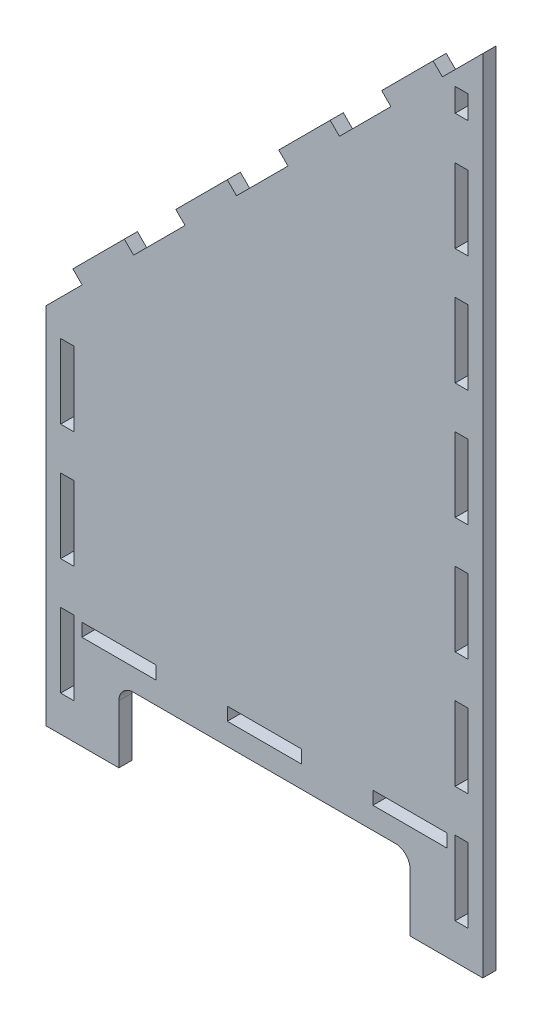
ISO-10303-21;
HEADER;
FILE_DESCRIPTION(('STEP AP214'),'2;1');
FILE_NAME('part.step','',(''),(''),'','','');
FILE_SCHEMA(('AUTOMOTIVE_DESIGN { 1 0 10303 214 1 1 1 1 }'));
ENDSEC;
DATA;
#1=APPLICATION_CONTEXT('core data for automotive mechanical design processes');
#2=APPLICATION_PROTOCOL_DEFINITION('international standard','automotive_design',2000,#1);
#3=PRODUCT_CONTEXT('',#1,'mechanical');
#4=PRODUCT('Part','Part','',(#3));
#5=PRODUCT_RELATED_PRODUCT_CATEGORY('part','',(#4));
#6=PRODUCT_DEFINITION_FORMATION('','',#4);
#7=PRODUCT_DEFINITION_CONTEXT('part definition',#1,'design');
#8=PRODUCT_DEFINITION('design','',#6,#7);
#9=PRODUCT_DEFINITION_SHAPE('','',#8);
#10=(LENGTH_UNIT() NAMED_UNIT(*) SI_UNIT(.MILLI.,.METRE.));
#11=(NAMED_UNIT(*) PLANE_ANGLE_UNIT() SI_UNIT($,.RADIAN.));
#12=(NAMED_UNIT(*) SI_UNIT($,.STERADIAN.) SOLID_ANGLE_UNIT());
#13=UNCERTAINTY_MEASURE_WITH_UNIT(LENGTH_MEASURE(1.E-05),#10,'distance_accuracy_value','');
#14=(GEOMETRIC_REPRESENTATION_CONTEXT(3) GLOBAL_UNCERTAINTY_ASSIGNED_CONTEXT((#13)) GLOBAL_UNIT_ASSIGNED_CONTEXT((#10,
#11,#12)) REPRESENTATION_CONTEXT('',''));
#15=CARTESIAN_POINT('',(0.,0.,0.));
#16=DIRECTION('',(0.,0.,1.));
#17=DIRECTION('',(1.,0.,0.));
#18=AXIS2_PLACEMENT_3D('',#15,#16,#17);
#19=CARTESIAN_POINT('',(281.,374.5,0.));
#20=DIRECTION('',(0.,-1.,0.));
#21=DIRECTION('',(0.,0.,-1.));
#22=AXIS2_PLACEMENT_3D('',#19,#20,#21);
#23=PLANE('',#22);
#24=DIRECTION('',(1.,0.,0.));
#25=VECTOR('',#24,1.);
#26=CARTESIAN_POINT('',(281.,374.5,9.));
#27=LINE('',#26,#25);
#28=CARTESIAN_POINT('',(281.,374.5,9.));
#29=VERTEX_POINT('',#28);
#30=CARTESIAN_POINT('',(290.,374.5,9.));
#31=VERTEX_POINT('',#30);
#32=EDGE_CURVE('E1100',#29,#31,#27,.T.);
#33=ORIENTED_EDGE('',*,*,#32,.T.);
#34=DIRECTION('',(0.,0.,1.));
#35=VECTOR('',#34,1.);
#36=CARTESIAN_POINT('',(290.,374.5,0.));
#37=LINE('',#36,#35);
#38=CARTESIAN_POINT('',(290.,374.5,0.));
#39=VERTEX_POINT('',#38);
#40=EDGE_CURVE('E11',#39,#31,#37,.T.);
#41=ORIENTED_EDGE('',*,*,#40,.F.);
#42=DIRECTION('',(1.,0.,0.));
#43=VECTOR('',#42,1.);
#44=CARTESIAN_POINT('',(281.,374.5,0.));
#45=LINE('',#44,#43);
#46=CARTESIAN_POINT('',(281.,374.5,0.));
#47=VERTEX_POINT('',#46);
#48=EDGE_CURVE('E1105',#47,#39,#45,.T.);
#49=ORIENTED_EDGE('',*,*,#48,.F.);
#50=DIRECTION('',(0.,0.,1.));
#51=VECTOR('',#50,1.);
#52=CARTESIAN_POINT('',(281.,374.5,0.));
#53=LINE('',#52,#51);
#54=EDGE_CURVE('E1112',#47,#29,#53,.T.);
#55=ORIENTED_EDGE('',*,*,#54,.T.);
#56=EDGE_LOOP('',(#33,#41,#49,#55));
#57=FACE_BOUND('',#56,.T.);
#58=ADVANCED_FACE('F34',(#57),#23,.F.);
#59=CARTESIAN_POINT('',(290.,425.5,0.));
#60=DIRECTION('',(1.,0.,0.));
#61=DIRECTION('',(0.,0.,-1.));
#62=AXIS2_PLACEMENT_3D('',#59,#60,#61);
#63=PLANE('',#62);
#64=DIRECTION('',(0.,1.,0.));
#65=VECTOR('',#64,1.);
#66=CARTESIAN_POINT('',(290.,425.5,9.));
#67=LINE('',#66,#65);
#68=CARTESIAN_POINT('',(290.,425.5,9.));
#69=VERTEX_POINT('',#68);
#70=EDGE_CURVE('E1097',#31,#69,#67,.T.);
#71=ORIENTED_EDGE('',*,*,#70,.T.);
#72=DIRECTION('',(0.,0.,1.));
#73=VECTOR('',#72,1.);
#74=CARTESIAN_POINT('',(290.,425.5,0.));
#75=LINE('',#74,#73);
#76=CARTESIAN_POINT('',(290.,425.5,0.));
#77=VERTEX_POINT('',#76);
#78=EDGE_CURVE('E41',#77,#69,#75,.T.);
#79=ORIENTED_EDGE('',*,*,#78,.F.);
#80=DIRECTION('',(0.,1.,0.));
#81=VECTOR('',#80,1.);
#82=CARTESIAN_POINT('',(290.,425.5,0.));
#83=LINE('',#82,#81);
#84=EDGE_CURVE('E1107',#39,#77,#83,.T.);
#85=ORIENTED_EDGE('',*,*,#84,.F.);
#86=ORIENTED_EDGE('',*,*,#40,.T.);
#87=EDGE_LOOP('',(#71,#79,#85,#86));
#88=FACE_BOUND('',#87,.T.);
#89=ADVANCED_FACE('F1125',(#88),#63,.F.);
#90=CARTESIAN_POINT('',(281.,425.5,0.));
#91=DIRECTION('',(0.,1.,0.));
#92=DIRECTION('',(-1.,0.,0.));
#93=AXIS2_PLACEMENT_3D('',#90,#91,#92);
#94=PLANE('',#93);
#95=DIRECTION('',(-1.,0.,0.));
#96=VECTOR('',#95,1.);
#97=CARTESIAN_POINT('',(281.,425.5,9.));
#98=LINE('',#97,#96);
#99=CARTESIAN_POINT('',(281.,425.5,9.));
#100=VERTEX_POINT('',#99);
#101=EDGE_CURVE('E1094',#69,#100,#98,.T.);
#102=ORIENTED_EDGE('',*,*,#101,.T.);
#103=DIRECTION('',(0.,0.,1.));
#104=VECTOR('',#103,1.);
#105=CARTESIAN_POINT('',(281.,425.5,0.));
#106=LINE('',#105,#104);
#107=CARTESIAN_POINT('',(281.,425.5,0.));
#108=VERTEX_POINT('',#107);
#109=EDGE_CURVE('E1115',#108,#100,#106,.T.);
#110=ORIENTED_EDGE('',*,*,#109,.F.);
#111=DIRECTION('',(-1.,0.,0.));
#112=VECTOR('',#111,1.);
#113=CARTESIAN_POINT('',(281.,425.5,0.));
#114=LINE('',#113,#112);
#115=EDGE_CURVE('E1109',#77,#108,#114,.T.);
#116=ORIENTED_EDGE('',*,*,#115,.F.);
#117=ORIENTED_EDGE('',*,*,#78,.T.);
#118=EDGE_LOOP('',(#102,#110,#116,#117));
#119=FACE_BOUND('',#118,.T.);
#120=ADVANCED_FACE('F1121',(#119),#94,.F.);
#121=CARTESIAN_POINT('',(281.,425.5,0.));
#122=DIRECTION('',(-1.,0.,0.));
#123=DIRECTION('',(0.,0.,1.));
#124=AXIS2_PLACEMENT_3D('',#121,#122,#123);
#125=PLANE('',#124);
#126=DIRECTION('',(0.,-1.,0.));
#127=VECTOR('',#126,1.);
#128=CARTESIAN_POINT('',(281.,425.5,9.));
#129=LINE('',#128,#127);
#130=EDGE_CURVE('E1092',#100,#29,#129,.T.);
#131=ORIENTED_EDGE('',*,*,#130,.T.);
#132=ORIENTED_EDGE('',*,*,#54,.F.);
#133=DIRECTION('',(0.,-1.,0.));
#134=VECTOR('',#133,1.);
#135=CARTESIAN_POINT('',(281.,425.5,0.));
#136=LINE('',#135,#134);
#137=EDGE_CURVE('E1103',#108,#47,#136,.T.);
#138=ORIENTED_EDGE('',*,*,#137,.F.);
#139=ORIENTED_EDGE('',*,*,#109,.T.);
#140=EDGE_LOOP('',(#131,#132,#138,#139));
#141=FACE_BOUND('',#140,.T.);
#142=ADVANCED_FACE('F1134',(#141),#125,.F.);
#143=CARTESIAN_POINT('',(281.,294.5,0.));
#144=DIRECTION('',(0.,-1.,0.));
#145=DIRECTION('',(0.,0.,-1.));
#146=AXIS2_PLACEMENT_3D('',#143,#144,#145);
#147=PLANE('',#146);
#148=DIRECTION('',(1.,0.,0.));
#149=VECTOR('',#148,1.);
#150=CARTESIAN_POINT('',(281.,294.5,9.));
#151=LINE('',#150,#149);
#152=CARTESIAN_POINT('',(281.,294.5,9.));
#153=VERTEX_POINT('',#152);
#154=CARTESIAN_POINT('',(290.,294.5,9.));
#155=VERTEX_POINT('',#154);
#156=EDGE_CURVE('E1068',#153,#155,#151,.T.);
#157=ORIENTED_EDGE('',*,*,#156,.T.);
#158=DIRECTION('',(0.,0.,1.));
#159=VECTOR('',#158,1.);
#160=CARTESIAN_POINT('',(290.,294.5,0.));
#161=LINE('',#160,#159);
#162=CARTESIAN_POINT('',(290.,294.5,0.));
#163=VERTEX_POINT('',#162);
#164=EDGE_CURVE('E1089',#163,#155,#161,.T.);
#165=ORIENTED_EDGE('',*,*,#164,.F.);
#166=DIRECTION('',(1.,0.,0.));
#167=VECTOR('',#166,1.);
#168=CARTESIAN_POINT('',(281.,294.5,0.));
#169=LINE('',#168,#167);
#170=CARTESIAN_POINT('',(281.,294.5,0.));
#171=VERTEX_POINT('',#170);
#172=EDGE_CURVE('E1073',#171,#163,#169,.T.);
#173=ORIENTED_EDGE('',*,*,#172,.F.);
#174=DIRECTION('',(0.,0.,1.));
#175=VECTOR('',#174,1.);
#176=CARTESIAN_POINT('',(281.,294.5,0.));
#177=LINE('',#176,#175);
#178=EDGE_CURVE('E1080',#171,#153,#177,.T.);
#179=ORIENTED_EDGE('',*,*,#178,.T.);
#180=EDGE_LOOP('',(#157,#165,#173,#179));
#181=FACE_BOUND('',#180,.T.);
#182=ADVANCED_FACE('F1161',(#181),#147,.F.);
#183=CARTESIAN_POINT('',(290.,345.5,0.));
#184=DIRECTION('',(1.,0.,0.));
#185=DIRECTION('',(0.,0.,-1.));
#186=AXIS2_PLACEMENT_3D('',#183,#184,#185);
#187=PLANE('',#186);
#188=DIRECTION('',(0.,1.,0.));
#189=VECTOR('',#188,1.);
#190=CARTESIAN_POINT('',(290.,345.5,9.));
#191=LINE('',#190,#189);
#192=CARTESIAN_POINT('',(290.,345.5,9.));
#193=VERTEX_POINT('',#192);
#194=EDGE_CURVE('E1065',#155,#193,#191,.T.);
#195=ORIENTED_EDGE('',*,*,#194,.T.);
#196=DIRECTION('',(0.,0.,1.));
#197=VECTOR('',#196,1.);
#198=CARTESIAN_POINT('',(290.,345.5,0.));
#199=LINE('',#198,#197);
#200=CARTESIAN_POINT('',(290.,345.5,0.));
#201=VERTEX_POINT('',#200);
#202=EDGE_CURVE('E1086',#201,#193,#199,.T.);
#203=ORIENTED_EDGE('',*,*,#202,.F.);
#204=DIRECTION('',(0.,1.,0.));
#205=VECTOR('',#204,1.);
#206=CARTESIAN_POINT('',(290.,345.5,0.));
#207=LINE('',#206,#205);
#208=EDGE_CURVE('E1075',#163,#201,#207,.T.);
#209=ORIENTED_EDGE('',*,*,#208,.F.);
#210=ORIENTED_EDGE('',*,*,#164,.T.);
#211=EDGE_LOOP('',(#195,#203,#209,#210));
#212=FACE_BOUND('',#211,.T.);
#213=ADVANCED_FACE('F1164',(#212),#187,.F.);
#214=CARTESIAN_POINT('',(281.,345.5,0.));
#215=DIRECTION('',(0.,1.,0.));
#216=DIRECTION('',(-1.,0.,0.));
#217=AXIS2_PLACEMENT_3D('',#214,#215,#216);
#218=PLANE('',#217);
#219=DIRECTION('',(-1.,0.,0.));
#220=VECTOR('',#219,1.);
#221=CARTESIAN_POINT('',(281.,345.5,9.));
#222=LINE('',#221,#220);
#223=CARTESIAN_POINT('',(281.,345.5,9.));
#224=VERTEX_POINT('',#223);
#225=EDGE_CURVE('E1062',#193,#224,#222,.T.);
#226=ORIENTED_EDGE('',*,*,#225,.T.);
#227=DIRECTION('',(0.,0.,1.));
#228=VECTOR('',#227,1.);
#229=CARTESIAN_POINT('',(281.,345.5,0.));
#230=LINE('',#229,#228);
#231=CARTESIAN_POINT('',(281.,345.5,0.));
#232=VERTEX_POINT('',#231);
#233=EDGE_CURVE('E1083',#232,#224,#230,.T.);
#234=ORIENTED_EDGE('',*,*,#233,.F.);
#235=DIRECTION('',(-1.,0.,0.));
#236=VECTOR('',#235,1.);
#237=CARTESIAN_POINT('',(281.,345.5,0.));
#238=LINE('',#237,#236);
#239=EDGE_CURVE('E1077',#201,#232,#238,.T.);
#240=ORIENTED_EDGE('',*,*,#239,.F.);
#241=ORIENTED_EDGE('',*,*,#202,.T.);
#242=EDGE_LOOP('',(#226,#234,#240,#241));
#243=FACE_BOUND('',#242,.T.);
#244=ADVANCED_FACE('F1168',(#243),#218,.F.);
#245=CARTESIAN_POINT('',(281.,345.5,0.));
#246=DIRECTION('',(-1.,0.,0.));
#247=DIRECTION('',(0.,0.,1.));
#248=AXIS2_PLACEMENT_3D('',#245,#246,#247);
#249=PLANE('',#248);
#250=DIRECTION('',(0.,-1.,0.));
#251=VECTOR('',#250,1.);
#252=CARTESIAN_POINT('',(281.,345.5,9.));
#253=LINE('',#252,#251);
#254=EDGE_CURVE('E1060',#224,#153,#253,.T.);
#255=ORIENTED_EDGE('',*,*,#254,.T.);
#256=ORIENTED_EDGE('',*,*,#178,.F.);
#257=DIRECTION('',(0.,-1.,0.));
#258=VECTOR('',#257,1.);
#259=CARTESIAN_POINT('',(281.,345.5,0.));
#260=LINE('',#259,#258);
#261=EDGE_CURVE('E1071',#232,#171,#260,.T.);
#262=ORIENTED_EDGE('',*,*,#261,.F.);
#263=ORIENTED_EDGE('',*,*,#233,.T.);
#264=EDGE_LOOP('',(#255,#256,#262,#263));
#265=FACE_BOUND('',#264,.T.);
#266=ADVANCED_FACE('F1172',(#265),#249,.F.);
#267=CARTESIAN_POINT('',(281.,214.5,0.));
#268=DIRECTION('',(0.,-1.,0.));
#269=DIRECTION('',(0.,0.,-1.));
#270=AXIS2_PLACEMENT_3D('',#267,#268,#269);
#271=PLANE('',#270);
#272=DIRECTION('',(1.,0.,0.));
#273=VECTOR('',#272,1.);
#274=CARTESIAN_POINT('',(281.,214.5,9.));
#275=LINE('',#274,#273);
#276=CARTESIAN_POINT('',(281.,214.5,9.));
#277=VERTEX_POINT('',#276);
#278=CARTESIAN_POINT('',(290.,214.5,9.));
#279=VERTEX_POINT('',#278);
#280=EDGE_CURVE('E1036',#277,#279,#275,.T.);
#281=ORIENTED_EDGE('',*,*,#280,.T.);
#282=DIRECTION('',(0.,0.,1.));
#283=VECTOR('',#282,1.);
#284=CARTESIAN_POINT('',(290.,214.5,0.));
#285=LINE('',#284,#283);
#286=CARTESIAN_POINT('',(290.,214.5,0.));
#287=VERTEX_POINT('',#286);
#288=EDGE_CURVE('E1057',#287,#279,#285,.T.);
#289=ORIENTED_EDGE('',*,*,#288,.F.);
#290=DIRECTION('',(1.,0.,0.));
#291=VECTOR('',#290,1.);
#292=CARTESIAN_POINT('',(281.,214.5,0.));
#293=LINE('',#292,#291);
#294=CARTESIAN_POINT('',(281.,214.5,0.));
#295=VERTEX_POINT('',#294);
#296=EDGE_CURVE('E1041',#295,#287,#293,.T.);
#297=ORIENTED_EDGE('',*,*,#296,.F.);
#298=DIRECTION('',(0.,0.,1.));
#299=VECTOR('',#298,1.);
#300=CARTESIAN_POINT('',(281.,214.5,0.));
#301=LINE('',#300,#299);
#302=EDGE_CURVE('E1048',#295,#277,#301,.T.);
#303=ORIENTED_EDGE('',*,*,#302,.T.);
#304=EDGE_LOOP('',(#281,#289,#297,#303));
#305=FACE_BOUND('',#304,.T.);
#306=ADVANCED_FACE('F1176',(#305),#271,.F.);
#307=CARTESIAN_POINT('',(290.,265.5,0.));
#308=DIRECTION('',(1.,0.,0.));
#309=DIRECTION('',(0.,0.,-1.));
#310=AXIS2_PLACEMENT_3D('',#307,#308,#309);
#311=PLANE('',#310);
#312=DIRECTION('',(0.,1.,0.));
#313=VECTOR('',#312,1.);
#314=CARTESIAN_POINT('',(290.,265.5,9.));
#315=LINE('',#314,#313);
#316=CARTESIAN_POINT('',(290.,265.5,9.));
#317=VERTEX_POINT('',#316);
#318=EDGE_CURVE('E1033',#279,#317,#315,.T.);
#319=ORIENTED_EDGE('',*,*,#318,.T.);
#320=DIRECTION('',(0.,0.,1.));
#321=VECTOR('',#320,1.);
#322=CARTESIAN_POINT('',(290.,265.5,0.));
#323=LINE('',#322,#321);
#324=CARTESIAN_POINT('',(290.,265.5,0.));
#325=VERTEX_POINT('',#324);
#326=EDGE_CURVE('E1054',#325,#317,#323,.T.);
#327=ORIENTED_EDGE('',*,*,#326,.F.);
#328=DIRECTION('',(0.,1.,0.));
#329=VECTOR('',#328,1.);
#330=CARTESIAN_POINT('',(290.,265.5,0.));
#331=LINE('',#330,#329);
#332=EDGE_CURVE('E1043',#287,#325,#331,.T.);
#333=ORIENTED_EDGE('',*,*,#332,.F.);
#334=ORIENTED_EDGE('',*,*,#288,.T.);
#335=EDGE_LOOP('',(#319,#327,#333,#334));
#336=FACE_BOUND('',#335,.T.);
#337=ADVANCED_FACE('F1180',(#336),#311,.F.);
#338=CARTESIAN_POINT('',(281.,265.5,0.));
#339=DIRECTION('',(0.,1.,0.));
#340=DIRECTION('',(-1.,0.,0.));
#341=AXIS2_PLACEMENT_3D('',#338,#339,#340);
#342=PLANE('',#341);
#343=DIRECTION('',(-1.,0.,0.));
#344=VECTOR('',#343,1.);
#345=CARTESIAN_POINT('',(281.,265.5,9.));
#346=LINE('',#345,#344);
#347=CARTESIAN_POINT('',(281.,265.5,9.));
#348=VERTEX_POINT('',#347);
#349=EDGE_CURVE('E1030',#317,#348,#346,.T.);
#350=ORIENTED_EDGE('',*,*,#349,.T.);
#351=DIRECTION('',(0.,0.,1.));
#352=VECTOR('',#351,1.);
#353=CARTESIAN_POINT('',(281.,265.5,0.));
#354=LINE('',#353,#352);
#355=CARTESIAN_POINT('',(281.,265.5,0.));
#356=VERTEX_POINT('',#355);
#357=EDGE_CURVE('E1051',#356,#348,#354,.T.);
#358=ORIENTED_EDGE('',*,*,#357,.F.);
#359=DIRECTION('',(-1.,0.,0.));
#360=VECTOR('',#359,1.);
#361=CARTESIAN_POINT('',(281.,265.5,0.));
#362=LINE('',#361,#360);
#363=EDGE_CURVE('E1045',#325,#356,#362,.T.);
#364=ORIENTED_EDGE('',*,*,#363,.F.);
#365=ORIENTED_EDGE('',*,*,#326,.T.);
#366=EDGE_LOOP('',(#350,#358,#364,#365));
#367=FACE_BOUND('',#366,.T.);
#368=ADVANCED_FACE('F1184',(#367),#342,.F.);
#369=CARTESIAN_POINT('',(281.,265.5,0.));
#370=DIRECTION('',(-1.,0.,0.));
#371=DIRECTION('',(0.,0.,1.));
#372=AXIS2_PLACEMENT_3D('',#369,#370,#371);
#373=PLANE('',#372);
#374=DIRECTION('',(0.,-1.,0.));
#375=VECTOR('',#374,1.);
#376=CARTESIAN_POINT('',(281.,265.5,9.));
#377=LINE('',#376,#375);
#378=EDGE_CURVE('E1028',#348,#277,#377,.T.);
#379=ORIENTED_EDGE('',*,*,#378,.T.);
#380=ORIENTED_EDGE('',*,*,#302,.F.);
#381=DIRECTION('',(0.,-1.,0.));
#382=VECTOR('',#381,1.);
#383=CARTESIAN_POINT('',(281.,265.5,0.));
#384=LINE('',#383,#382);
#385=EDGE_CURVE('E1039',#356,#295,#384,.T.);
#386=ORIENTED_EDGE('',*,*,#385,.F.);
#387=ORIENTED_EDGE('',*,*,#357,.T.);
#388=EDGE_LOOP('',(#379,#380,#386,#387));
#389=FACE_BOUND('',#388,.T.);
#390=ADVANCED_FACE('F1188',(#389),#373,.F.);
#391=CARTESIAN_POINT('',(281.,134.5,0.));
#392=DIRECTION('',(0.,-1.,0.));
#393=DIRECTION('',(0.,0.,-1.));
#394=AXIS2_PLACEMENT_3D('',#391,#392,#393);
#395=PLANE('',#394);
#396=DIRECTION('',(1.,0.,0.));
#397=VECTOR('',#396,1.);
#398=CARTESIAN_POINT('',(281.,134.5,9.));
#399=LINE('',#398,#397);
#400=CARTESIAN_POINT('',(281.,134.5,9.));
#401=VERTEX_POINT('',#400);
#402=CARTESIAN_POINT('',(290.,134.5,9.));
#403=VERTEX_POINT('',#402);
#404=EDGE_CURVE('E1004',#401,#403,#399,.T.);
#405=ORIENTED_EDGE('',*,*,#404,.T.);
#406=DIRECTION('',(0.,0.,1.));
#407=VECTOR('',#406,1.);
#408=CARTESIAN_POINT('',(290.,134.5,0.));
#409=LINE('',#408,#407);
#410=CARTESIAN_POINT('',(290.,134.5,0.));
#411=VERTEX_POINT('',#410);
#412=EDGE_CURVE('E1025',#411,#403,#409,.T.);
#413=ORIENTED_EDGE('',*,*,#412,.F.);
#414=DIRECTION('',(1.,0.,0.));
#415=VECTOR('',#414,1.);
#416=CARTESIAN_POINT('',(281.,134.5,0.));
#417=LINE('',#416,#415);
#418=CARTESIAN_POINT('',(281.,134.5,0.));
#419=VERTEX_POINT('',#418);
#420=EDGE_CURVE('E1009',#419,#411,#417,.T.);
#421=ORIENTED_EDGE('',*,*,#420,.F.);
#422=DIRECTION('',(0.,0.,1.));
#423=VECTOR('',#422,1.);
#424=CARTESIAN_POINT('',(281.,134.5,0.));
#425=LINE('',#424,#423);
#426=EDGE_CURVE('E1016',#419,#401,#425,.T.);
#427=ORIENTED_EDGE('',*,*,#426,.T.);
#428=EDGE_LOOP('',(#405,#413,#421,#427));
#429=FACE_BOUND('',#428,.T.);
#430=ADVANCED_FACE('F1192',(#429),#395,.F.);
#431=CARTESIAN_POINT('',(290.,185.5,0.));
#432=DIRECTION('',(1.,0.,0.));
#433=DIRECTION('',(0.,0.,-1.));
#434=AXIS2_PLACEMENT_3D('',#431,#432,#433);
#435=PLANE('',#434);
#436=DIRECTION('',(0.,1.,0.));
#437=VECTOR('',#436,1.);
#438=CARTESIAN_POINT('',(290.,185.5,9.));
#439=LINE('',#438,#437);
#440=CARTESIAN_POINT('',(290.,185.5,9.));
#441=VERTEX_POINT('',#440);
#442=EDGE_CURVE('E1001',#403,#441,#439,.T.);
#443=ORIENTED_EDGE('',*,*,#442,.T.);
#444=DIRECTION('',(0.,0.,1.));
#445=VECTOR('',#444,1.);
#446=CARTESIAN_POINT('',(290.,185.5,0.));
#447=LINE('',#446,#445);
#448=CARTESIAN_POINT('',(290.,185.5,0.));
#449=VERTEX_POINT('',#448);
#450=EDGE_CURVE('E1022',#449,#441,#447,.T.);
#451=ORIENTED_EDGE('',*,*,#450,.F.);
#452=DIRECTION('',(0.,1.,0.));
#453=VECTOR('',#452,1.);
#454=CARTESIAN_POINT('',(290.,185.5,0.));
#455=LINE('',#454,#453);
#456=EDGE_CURVE('E1011',#411,#449,#455,.T.);
#457=ORIENTED_EDGE('',*,*,#456,.F.);
#458=ORIENTED_EDGE('',*,*,#412,.T.);
#459=EDGE_LOOP('',(#443,#451,#457,#458));
#460=FACE_BOUND('',#459,.T.);
#461=ADVANCED_FACE('F1196',(#460),#435,.F.);
#462=CARTESIAN_POINT('',(281.,185.5,0.));
#463=DIRECTION('',(0.,1.,0.));
#464=DIRECTION('',(-1.,0.,0.));
#465=AXIS2_PLACEMENT_3D('',#462,#463,#464);
#466=PLANE('',#465);
#467=DIRECTION('',(-1.,0.,0.));
#468=VECTOR('',#467,1.);
#469=CARTESIAN_POINT('',(281.,185.5,9.));
#470=LINE('',#469,#468);
#471=CARTESIAN_POINT('',(281.,185.5,9.));
#472=VERTEX_POINT('',#471);
#473=EDGE_CURVE('E998',#441,#472,#470,.T.);
#474=ORIENTED_EDGE('',*,*,#473,.T.);
#475=DIRECTION('',(0.,0.,1.));
#476=VECTOR('',#475,1.);
#477=CARTESIAN_POINT('',(281.,185.5,0.));
#478=LINE('',#477,#476);
#479=CARTESIAN_POINT('',(281.,185.5,0.));
#480=VERTEX_POINT('',#479);
#481=EDGE_CURVE('E1019',#480,#472,#478,.T.);
#482=ORIENTED_EDGE('',*,*,#481,.F.);
#483=DIRECTION('',(-1.,0.,0.));
#484=VECTOR('',#483,1.);
#485=CARTESIAN_POINT('',(281.,185.5,0.));
#486=LINE('',#485,#484);
#487=EDGE_CURVE('E1013',#449,#480,#486,.T.);
#488=ORIENTED_EDGE('',*,*,#487,.F.);
#489=ORIENTED_EDGE('',*,*,#450,.T.);
#490=EDGE_LOOP('',(#474,#482,#488,#489));
#491=FACE_BOUND('',#490,.T.);
#492=ADVANCED_FACE('F1200',(#491),#466,.F.);
#493=CARTESIAN_POINT('',(281.,185.5,0.));
#494=DIRECTION('',(-1.,0.,0.));
#495=DIRECTION('',(0.,0.,1.));
#496=AXIS2_PLACEMENT_3D('',#493,#494,#495);
#497=PLANE('',#496);
#498=DIRECTION('',(0.,-1.,0.));
#499=VECTOR('',#498,1.);
#500=CARTESIAN_POINT('',(281.,185.5,9.));
#501=LINE('',#500,#499);
#502=EDGE_CURVE('E996',#472,#401,#501,.T.);
#503=ORIENTED_EDGE('',*,*,#502,.T.);
#504=ORIENTED_EDGE('',*,*,#426,.F.);
#505=DIRECTION('',(0.,-1.,0.));
#506=VECTOR('',#505,1.);
#507=CARTESIAN_POINT('',(281.,185.5,0.));
#508=LINE('',#507,#506);
#509=EDGE_CURVE('E1007',#480,#419,#508,.T.);
#510=ORIENTED_EDGE('',*,*,#509,.F.);
#511=ORIENTED_EDGE('',*,*,#481,.T.);
#512=EDGE_LOOP('',(#503,#504,#510,#511));
#513=FACE_BOUND('',#512,.T.);
#514=ADVANCED_FACE('F1204',(#513),#497,.F.);
#515=CARTESIAN_POINT('',(10.0000000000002,134.5,0.));
#516=DIRECTION('',(0.,-1.,0.));
#517=DIRECTION('',(1.,0.,0.));
#518=AXIS2_PLACEMENT_3D('',#515,#516,#517);
#519=PLANE('',#518);
#520=DIRECTION('',(1.,0.,0.));
#521=VECTOR('',#520,1.);
#522=CARTESIAN_POINT('',(10.0000000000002,134.5,9.));
#523=LINE('',#522,#521);
#524=CARTESIAN_POINT('',(10.0000000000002,134.5,9.));
#525=VERTEX_POINT('',#524);
#526=CARTESIAN_POINT('',(19.0000000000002,134.5,9.));
#527=VERTEX_POINT('',#526);
#528=EDGE_CURVE('E972',#525,#527,#523,.T.);
#529=ORIENTED_EDGE('',*,*,#528,.T.);
#530=DIRECTION('',(0.,0.,1.));
#531=VECTOR('',#530,1.);
#532=CARTESIAN_POINT('',(19.0000000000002,134.5,0.));
#533=LINE('',#532,#531);
#534=CARTESIAN_POINT('',(19.0000000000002,134.5,0.));
#535=VERTEX_POINT('',#534);
#536=EDGE_CURVE('E993',#535,#527,#533,.T.);
#537=ORIENTED_EDGE('',*,*,#536,.F.);
#538=DIRECTION('',(1.,0.,0.));
#539=VECTOR('',#538,1.);
#540=CARTESIAN_POINT('',(10.0000000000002,134.5,0.));
#541=LINE('',#540,#539);
#542=CARTESIAN_POINT('',(10.0000000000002,134.5,0.));
#543=VERTEX_POINT('',#542);
#544=EDGE_CURVE('E977',#543,#535,#541,.T.);
#545=ORIENTED_EDGE('',*,*,#544,.F.);
#546=DIRECTION('',(0.,0.,1.));
#547=VECTOR('',#546,1.);
#548=CARTESIAN_POINT('',(10.0000000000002,134.5,0.));
#549=LINE('',#548,#547);
#550=EDGE_CURVE('E984',#543,#525,#549,.T.);
#551=ORIENTED_EDGE('',*,*,#550,.T.);
#552=EDGE_LOOP('',(#529,#537,#545,#551));
#553=FACE_BOUND('',#552,.T.);
#554=ADVANCED_FACE('F1208',(#553),#519,.F.);
#555=CARTESIAN_POINT('',(19.0000000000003,185.5,0.));
#556=DIRECTION('',(1.,0.,0.));
#557=DIRECTION('',(0.,1.,0.));
#558=AXIS2_PLACEMENT_3D('',#555,#556,#557);
#559=PLANE('',#558);
#560=DIRECTION('',(0.,1.,0.));
#561=VECTOR('',#560,1.);
#562=CARTESIAN_POINT('',(19.0000000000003,185.5,9.));
#563=LINE('',#562,#561);
#564=CARTESIAN_POINT('',(19.0000000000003,185.5,9.));
#565=VERTEX_POINT('',#564);
#566=EDGE_CURVE('E969',#527,#565,#563,.T.);
#567=ORIENTED_EDGE('',*,*,#566,.T.);
#568=DIRECTION('',(0.,0.,1.));
#569=VECTOR('',#568,1.);
#570=CARTESIAN_POINT('',(19.0000000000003,185.5,0.));
#571=LINE('',#570,#569);
#572=CARTESIAN_POINT('',(19.0000000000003,185.5,0.));
#573=VERTEX_POINT('',#572);
#574=EDGE_CURVE('E990',#573,#565,#571,.T.);
#575=ORIENTED_EDGE('',*,*,#574,.F.);
#576=DIRECTION('',(0.,1.,0.));
#577=VECTOR('',#576,1.);
#578=CARTESIAN_POINT('',(19.0000000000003,185.5,0.));
#579=LINE('',#578,#577);
#580=EDGE_CURVE('E979',#535,#573,#579,.T.);
#581=ORIENTED_EDGE('',*,*,#580,.F.);
#582=ORIENTED_EDGE('',*,*,#536,.T.);
#583=EDGE_LOOP('',(#567,#575,#581,#582));
#584=FACE_BOUND('',#583,.T.);
#585=ADVANCED_FACE('F1212',(#584),#559,.F.);
#586=CARTESIAN_POINT('',(10.0000000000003,185.5,0.));
#587=DIRECTION('',(0.,1.,0.));
#588=DIRECTION('',(-1.,0.,0.));
#589=AXIS2_PLACEMENT_3D('',#586,#587,#588);
#590=PLANE('',#589);
#591=DIRECTION('',(-1.,0.,0.));
#592=VECTOR('',#591,1.);
#593=CARTESIAN_POINT('',(10.0000000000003,185.5,9.));
#594=LINE('',#593,#592);
#595=CARTESIAN_POINT('',(10.0000000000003,185.5,9.));
#596=VERTEX_POINT('',#595);
#597=EDGE_CURVE('E966',#565,#596,#594,.T.);
#598=ORIENTED_EDGE('',*,*,#597,.T.);
#599=DIRECTION('',(0.,0.,1.));
#600=VECTOR('',#599,1.);
#601=CARTESIAN_POINT('',(10.0000000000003,185.5,0.));
#602=LINE('',#601,#600);
#603=CARTESIAN_POINT('',(10.0000000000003,185.5,0.));
#604=VERTEX_POINT('',#603);
#605=EDGE_CURVE('E987',#604,#596,#602,.T.);
#606=ORIENTED_EDGE('',*,*,#605,.F.);
#607=DIRECTION('',(-1.,0.,0.));
#608=VECTOR('',#607,1.);
#609=CARTESIAN_POINT('',(10.0000000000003,185.5,0.));
#610=LINE('',#609,#608);
#611=EDGE_CURVE('E981',#573,#604,#610,.T.);
#612=ORIENTED_EDGE('',*,*,#611,.F.);
#613=ORIENTED_EDGE('',*,*,#574,.T.);
#614=EDGE_LOOP('',(#598,#606,#612,#613));
#615=FACE_BOUND('',#614,.T.);
#616=ADVANCED_FACE('F1216',(#615),#590,.F.);
#617=CARTESIAN_POINT('',(10.0000000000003,185.5,0.));
#618=DIRECTION('',(-1.,0.,0.));
#619=DIRECTION('',(0.,-1.,0.));
#620=AXIS2_PLACEMENT_3D('',#617,#618,#619);
#621=PLANE('',#620);
#622=DIRECTION('',(0.,-1.,0.));
#623=VECTOR('',#622,1.);
#624=CARTESIAN_POINT('',(10.0000000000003,185.5,9.));
#625=LINE('',#624,#623);
#626=EDGE_CURVE('E964',#596,#525,#625,.T.);
#627=ORIENTED_EDGE('',*,*,#626,.T.);
#628=ORIENTED_EDGE('',*,*,#550,.F.);
#629=DIRECTION('',(0.,-1.,0.));
#630=VECTOR('',#629,1.);
#631=CARTESIAN_POINT('',(10.0000000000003,185.5,0.));
#632=LINE('',#631,#630);
#633=EDGE_CURVE('E975',#604,#543,#632,.T.);
#634=ORIENTED_EDGE('',*,*,#633,.F.);
#635=ORIENTED_EDGE('',*,*,#605,.T.);
#636=EDGE_LOOP('',(#627,#628,#634,#635));
#637=FACE_BOUND('',#636,.T.);
#638=ADVANCED_FACE('F1220',(#637),#621,.F.);
#639=CARTESIAN_POINT('',(224.5,24.,9.));
#640=DIRECTION('',(0.,-1.,0.));
#641=DIRECTION('',(1.,0.,0.));
#642=AXIS2_PLACEMENT_3D('',#639,#640,#641);
#643=PLANE('',#642);
#644=DIRECTION('',(-1.,0.,0.));
#645=VECTOR('',#644,1.);
#646=CARTESIAN_POINT('',(224.5,24.,0.));
#647=LINE('',#646,#645);
#648=CARTESIAN_POINT('',(275.5,24.,0.));
#649=VERTEX_POINT('',#648);
#650=CARTESIAN_POINT('',(224.5,24.,0.));
#651=VERTEX_POINT('',#650);
#652=EDGE_CURVE('E938',#649,#651,#647,.T.);
#653=ORIENTED_EDGE('',*,*,#652,.F.);
#654=DIRECTION('',(0.,0.,-1.));
#655=VECTOR('',#654,1.);
#656=CARTESIAN_POINT('',(275.5,24.,9.));
#657=LINE('',#656,#655);
#658=CARTESIAN_POINT('',(275.5,24.,9.));
#659=VERTEX_POINT('',#658);
#660=EDGE_CURVE('E961',#659,#649,#657,.T.);
#661=ORIENTED_EDGE('',*,*,#660,.F.);
#662=DIRECTION('',(-1.,0.,0.));
#663=VECTOR('',#662,1.);
#664=CARTESIAN_POINT('',(224.5,24.,9.));
#665=LINE('',#664,#663);
#666=CARTESIAN_POINT('',(224.5,24.,9.));
#667=VERTEX_POINT('',#666);
#668=EDGE_CURVE('E943',#659,#667,#665,.T.);
#669=ORIENTED_EDGE('',*,*,#668,.T.);
#670=DIRECTION('',(0.,0.,-1.));
#671=VECTOR('',#670,1.);
#672=CARTESIAN_POINT('',(224.5,24.,9.));
#673=LINE('',#672,#671);
#674=EDGE_CURVE('E952',#667,#651,#673,.T.);
#675=ORIENTED_EDGE('',*,*,#674,.T.);
#676=EDGE_LOOP('',(#653,#661,#669,#675));
#677=FACE_BOUND('',#676,.T.);
#678=ADVANCED_FACE('F1224',(#677),#643,.T.);
#679=CARTESIAN_POINT('',(275.5,24.,9.));
#680=DIRECTION('',(-1.,0.,0.));
#681=DIRECTION('',(0.,0.,1.));
#682=AXIS2_PLACEMENT_3D('',#679,#680,#681);
#683=PLANE('',#682);
#684=DIRECTION('',(0.,1.,0.));
#685=VECTOR('',#684,1.);
#686=CARTESIAN_POINT('',(275.5,24.,0.));
#687=LINE('',#686,#685);
#688=CARTESIAN_POINT('',(275.5,15.,0.));
#689=VERTEX_POINT('',#688);
#690=EDGE_CURVE('E936',#689,#649,#687,.T.);
#691=ORIENTED_EDGE('',*,*,#690,.F.);
#692=DIRECTION('',(0.,0.,-1.));
#693=VECTOR('',#692,1.);
#694=CARTESIAN_POINT('',(275.5,15.,9.));
#695=LINE('',#694,#693);
#696=CARTESIAN_POINT('',(275.5,15.,9.));
#697=VERTEX_POINT('',#696);
#698=EDGE_CURVE('E958',#697,#689,#695,.T.);
#699=ORIENTED_EDGE('',*,*,#698,.F.);
#700=DIRECTION('',(0.,1.,0.));
#701=VECTOR('',#700,1.);
#702=CARTESIAN_POINT('',(275.5,24.,9.));
#703=LINE('',#702,#701);
#704=EDGE_CURVE('E946',#697,#659,#703,.T.);
#705=ORIENTED_EDGE('',*,*,#704,.T.);
#706=ORIENTED_EDGE('',*,*,#660,.T.);
#707=EDGE_LOOP('',(#691,#699,#705,#706));
#708=FACE_BOUND('',#707,.T.);
#709=ADVANCED_FACE('F1228',(#708),#683,.T.);
#710=CARTESIAN_POINT('',(224.5,15.,9.));
#711=DIRECTION('',(0.,1.,0.));
#712=DIRECTION('',(0.,0.,1.));
#713=AXIS2_PLACEMENT_3D('',#710,#711,#712);
#714=PLANE('',#713);
#715=DIRECTION('',(1.,0.,0.));
#716=VECTOR('',#715,1.);
#717=CARTESIAN_POINT('',(224.5,15.,0.));
#718=LINE('',#717,#716);
#719=CARTESIAN_POINT('',(224.5,15.,0.));
#720=VERTEX_POINT('',#719);
#721=EDGE_CURVE('E934',#720,#689,#718,.T.);
#722=ORIENTED_EDGE('',*,*,#721,.F.);
#723=DIRECTION('',(0.,0.,-1.));
#724=VECTOR('',#723,1.);
#725=CARTESIAN_POINT('',(224.5,15.,9.));
#726=LINE('',#725,#724);
#727=CARTESIAN_POINT('',(224.5,15.,9.));
#728=VERTEX_POINT('',#727);
#729=EDGE_CURVE('E955',#728,#720,#726,.T.);
#730=ORIENTED_EDGE('',*,*,#729,.F.);
#731=DIRECTION('',(1.,0.,0.));
#732=VECTOR('',#731,1.);
#733=CARTESIAN_POINT('',(224.5,15.,9.));
#734=LINE('',#733,#732);
#735=EDGE_CURVE('E949',#728,#697,#734,.T.);
#736=ORIENTED_EDGE('',*,*,#735,.T.);
#737=ORIENTED_EDGE('',*,*,#698,.T.);
#738=EDGE_LOOP('',(#722,#730,#736,#737));
#739=FACE_BOUND('',#738,.T.);
#740=ADVANCED_FACE('F1232',(#739),#714,.T.);
#741=CARTESIAN_POINT('',(224.5,24.,9.));
#742=DIRECTION('',(1.,0.,0.));
#743=DIRECTION('',(0.,1.,0.));
#744=AXIS2_PLACEMENT_3D('',#741,#742,#743);
#745=PLANE('',#744);
#746=DIRECTION('',(0.,-1.,0.));
#747=VECTOR('',#746,1.);
#748=CARTESIAN_POINT('',(224.5,24.,0.));
#749=LINE('',#748,#747);
#750=EDGE_CURVE('E932',#651,#720,#749,.T.);
#751=ORIENTED_EDGE('',*,*,#750,.F.);
#752=ORIENTED_EDGE('',*,*,#674,.F.);
#753=DIRECTION('',(0.,-1.,0.));
#754=VECTOR('',#753,1.);
#755=CARTESIAN_POINT('',(224.5,24.,9.));
#756=LINE('',#755,#754);
#757=EDGE_CURVE('E941',#667,#728,#756,.T.);
#758=ORIENTED_EDGE('',*,*,#757,.T.);
#759=ORIENTED_EDGE('',*,*,#729,.T.);
#760=EDGE_LOOP('',(#751,#752,#758,#759));
#761=FACE_BOUND('',#760,.T.);
#762=ADVANCED_FACE('F1146',(#761),#745,.T.);
#763=CARTESIAN_POINT('',(60.,-10.,9.));
#764=DIRECTION('',(0.,0.,1.));
#765=DIRECTION('',(1.,0.,0.));
#766=AXIS2_PLACEMENT_3D('',#763,#764,#765);
#767=PLANE('',#766);
#768=DIRECTION('',(0.,-1.,0.));
#769=VECTOR('',#768,1.);
#770=CARTESIAN_POINT('',(281.,471.,9.));
#771=LINE('',#770,#769);
#772=CARTESIAN_POINT('',(281.,471.,9.));
#773=VERTEX_POINT('',#772);
#774=CARTESIAN_POINT('',(281.,455.,9.));
#775=VERTEX_POINT('',#774);
#776=EDGE_CURVE('E48',#773,#775,#771,.T.);
#777=ORIENTED_EDGE('',*,*,#776,.F.);
#778=DIRECTION('',(-1.,0.,0.));
#779=VECTOR('',#778,1.);
#780=CARTESIAN_POINT('',(281.,471.,9.));
#781=LINE('',#780,#779);
#782=CARTESIAN_POINT('',(290.,471.,9.));
#783=VERTEX_POINT('',#782);
#784=EDGE_CURVE('E536',#783,#773,#781,.T.);
#785=ORIENTED_EDGE('',*,*,#784,.F.);
#786=DIRECTION('',(0.,1.,0.));
#787=VECTOR('',#786,1.);
#788=CARTESIAN_POINT('',(290.,471.,9.));
#789=LINE('',#788,#787);
#790=CARTESIAN_POINT('',(290.,455.,9.));
#791=VERTEX_POINT('',#790);
#792=EDGE_CURVE('E539',#791,#783,#789,.T.);
#793=ORIENTED_EDGE('',*,*,#792,.F.);
#794=DIRECTION('',(1.,0.,0.));
#795=VECTOR('',#794,1.);
#796=CARTESIAN_POINT('',(281.,455.,9.));
#797=LINE('',#796,#795);
#798=EDGE_CURVE('E545',#775,#791,#797,.T.);
#799=ORIENTED_EDGE('',*,*,#798,.F.);
#800=EDGE_LOOP('',(#777,#785,#793,#799));
#801=FACE_BOUND('',#800,.T.);
#802=DIRECTION('',(0.,-1.,0.));
#803=VECTOR('',#802,1.);
#804=CARTESIAN_POINT('',(281.,105.5,9.));
#805=LINE('',#804,#803);
#806=CARTESIAN_POINT('',(281.,105.5,9.));
#807=VERTEX_POINT('',#806);
#808=CARTESIAN_POINT('',(281.,54.5,9.));
#809=VERTEX_POINT('',#808);
#810=EDGE_CURVE('E581',#807,#809,#805,.T.);
#811=ORIENTED_EDGE('',*,*,#810,.F.);
#812=DIRECTION('',(-1.,0.,0.));
#813=VECTOR('',#812,1.);
#814=CARTESIAN_POINT('',(281.,105.5,9.));
#815=LINE('',#814,#813);
#816=CARTESIAN_POINT('',(290.,105.5,9.));
#817=VERTEX_POINT('',#816);
#818=EDGE_CURVE('E573',#817,#807,#815,.T.);
#819=ORIENTED_EDGE('',*,*,#818,.F.);
#820=DIRECTION('',(0.,1.,0.));
#821=VECTOR('',#820,1.);
#822=CARTESIAN_POINT('',(290.,105.5,9.));
#823=LINE('',#822,#821);
#824=CARTESIAN_POINT('',(290.,54.5,9.));
#825=VERTEX_POINT('',#824);
#826=EDGE_CURVE('E565',#825,#817,#823,.T.);
#827=ORIENTED_EDGE('',*,*,#826,.F.);
#828=DIRECTION('',(1.,0.,0.));
#829=VECTOR('',#828,1.);
#830=CARTESIAN_POINT('',(281.,54.5,9.));
#831=LINE('',#830,#829);
#832=EDGE_CURVE('E551',#809,#825,#831,.T.);
#833=ORIENTED_EDGE('',*,*,#832,.F.);
#834=EDGE_LOOP('',(#811,#819,#827,#833));
#835=FACE_BOUND('',#834,.T.);
#836=DIRECTION('',(0.,-1.,0.));
#837=VECTOR('',#836,1.);
#838=CARTESIAN_POINT('',(10.0000000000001,105.5,9.));
#839=LINE('',#838,#837);
#840=CARTESIAN_POINT('',(10.0000000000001,105.5,9.));
#841=VERTEX_POINT('',#840);
#842=CARTESIAN_POINT('',(9.99999999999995,54.5,9.));
#843=VERTEX_POINT('',#842);
#844=EDGE_CURVE('E613',#841,#843,#839,.T.);
#845=ORIENTED_EDGE('',*,*,#844,.F.);
#846=DIRECTION('',(-1.,0.,0.));
#847=VECTOR('',#846,1.);
#848=CARTESIAN_POINT('',(10.0000000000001,105.5,9.));
#849=LINE('',#848,#847);
#850=CARTESIAN_POINT('',(19.0000000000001,105.5,9.));
#851=VERTEX_POINT('',#850);
#852=EDGE_CURVE('E605',#851,#841,#849,.T.);
#853=ORIENTED_EDGE('',*,*,#852,.F.);
#854=DIRECTION('',(0.,1.,0.));
#855=VECTOR('',#854,1.);
#856=CARTESIAN_POINT('',(19.0000000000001,105.5,9.));
#857=LINE('',#856,#855);
#858=CARTESIAN_POINT('',(19.,54.5,9.));
#859=VERTEX_POINT('',#858);
#860=EDGE_CURVE('E597',#859,#851,#857,.T.);
#861=ORIENTED_EDGE('',*,*,#860,.F.);
#862=DIRECTION('',(1.,0.,0.));
#863=VECTOR('',#862,1.);
#864=CARTESIAN_POINT('',(9.99999999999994,54.5,9.));
#865=LINE('',#864,#863);
#866=EDGE_CURVE('E586',#843,#859,#865,.T.);
#867=ORIENTED_EDGE('',*,*,#866,.F.);
#868=EDGE_LOOP('',(#845,#853,#861,#867));
#869=FACE_BOUND('',#868,.T.);
#870=DIRECTION('',(0.,-1.,0.));
#871=VECTOR('',#870,1.);
#872=CARTESIAN_POINT('',(281.,25.5,9.));
#873=LINE('',#872,#871);
#874=CARTESIAN_POINT('',(281.,25.5,9.));
#875=VERTEX_POINT('',#874);
#876=CARTESIAN_POINT('',(281.,-25.5,9.));
#877=VERTEX_POINT('',#876);
#878=EDGE_CURVE('E652',#875,#877,#873,.T.);
#879=ORIENTED_EDGE('',*,*,#878,.F.);
#880=DIRECTION('',(-1.,0.,0.));
#881=VECTOR('',#880,1.);
#882=CARTESIAN_POINT('',(281.,25.5,9.));
#883=LINE('',#882,#881);
#884=CARTESIAN_POINT('',(290.,25.5,9.));
#885=VERTEX_POINT('',#884);
#886=EDGE_CURVE('E657',#885,#875,#883,.T.);
#887=ORIENTED_EDGE('',*,*,#886,.F.);
#888=DIRECTION('',(0.,1.,0.));
#889=VECTOR('',#888,1.);
#890=CARTESIAN_POINT('',(290.,25.5,9.));
#891=LINE('',#890,#889);
#892=CARTESIAN_POINT('',(290.,-25.5,9.));
#893=VERTEX_POINT('',#892);
#894=EDGE_CURVE('E671',#893,#885,#891,.T.);
#895=ORIENTED_EDGE('',*,*,#894,.F.);
#896=DIRECTION('',(1.,0.,0.));
#897=VECTOR('',#896,1.);
#898=CARTESIAN_POINT('',(281.,-25.5,9.));
#899=LINE('',#898,#897);
#900=EDGE_CURVE('E668',#877,#893,#899,.T.);
#901=ORIENTED_EDGE('',*,*,#900,.F.);
#902=EDGE_LOOP('',(#879,#887,#895,#901));
#903=FACE_BOUND('',#902,.T.);
#904=DIRECTION('',(0.,-1.,0.));
#905=VECTOR('',#904,1.);
#906=CARTESIAN_POINT('',(9.99999999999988,25.5,9.));
#907=LINE('',#906,#905);
#908=CARTESIAN_POINT('',(9.99999999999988,25.5,9.));
#909=VERTEX_POINT('',#908);
#910=CARTESIAN_POINT('',(9.99999999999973,-25.5,9.));
#911=VERTEX_POINT('',#910);
#912=EDGE_CURVE('E678',#909,#911,#907,.T.);
#913=ORIENTED_EDGE('',*,*,#912,.F.);
#914=DIRECTION('',(-1.,0.,0.));
#915=VECTOR('',#914,1.);
#916=CARTESIAN_POINT('',(9.99999999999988,25.5,9.));
#917=LINE('',#916,#915);
#918=CARTESIAN_POINT('',(18.9999999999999,25.5,9.));
#919=VERTEX_POINT('',#918);
#920=EDGE_CURVE('E689',#919,#909,#917,.T.);
#921=ORIENTED_EDGE('',*,*,#920,.F.);
#922=DIRECTION('',(0.,1.,0.));
#923=VECTOR('',#922,1.);
#924=CARTESIAN_POINT('',(18.9999999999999,25.5,9.));
#925=LINE('',#924,#923);
#926=CARTESIAN_POINT('',(18.9999999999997,-25.5,9.));
#927=VERTEX_POINT('',#926);
#928=EDGE_CURVE('E703',#927,#919,#925,.T.);
#929=ORIENTED_EDGE('',*,*,#928,.F.);
#930=DIRECTION('',(1.,0.,0.));
#931=VECTOR('',#930,1.);
#932=CARTESIAN_POINT('',(9.99999999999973,-25.5,9.));
#933=LINE('',#932,#931);
#934=EDGE_CURVE('E700',#911,#927,#933,.T.);
#935=ORIENTED_EDGE('',*,*,#934,.F.);
#936=EDGE_LOOP('',(#913,#921,#929,#935));
#937=FACE_BOUND('',#936,.T.);
#938=DIRECTION('',(0.,-1.,0.));
#939=VECTOR('',#938,1.);
#940=CARTESIAN_POINT('',(0.,0.,9.));
#941=LINE('',#940,#939);
#942=CARTESIAN_POINT('',(-1.45716771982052E-13,199.999999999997,9.));
#943=VERTEX_POINT('',#942);
#944=CARTESIAN_POINT('',(0.,-50.,9.));
#945=VERTEX_POINT('',#944);
#946=EDGE_CURVE('E748',#943,#945,#941,.T.);
#947=ORIENTED_EDGE('',*,*,#946,.T.);
#948=DIRECTION('',(1.,0.,0.));
#949=VECTOR('',#948,1.);
#950=CARTESIAN_POINT('',(0.,-50.,9.));
#951=LINE('',#950,#949);
#952=CARTESIAN_POINT('',(50.,-50.,9.));
#953=VERTEX_POINT('',#952);
#954=EDGE_CURVE('E751',#945,#953,#951,.T.);
#955=ORIENTED_EDGE('',*,*,#954,.T.);
#956=DIRECTION('',(0.,1.,0.));
#957=VECTOR('',#956,1.);
#958=CARTESIAN_POINT('',(50.,-50.,9.));
#959=LINE('',#958,#957);
#960=CARTESIAN_POINT('',(50.,-10.0000000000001,9.));
#961=VERTEX_POINT('',#960);
#962=EDGE_CURVE('E754',#953,#961,#959,.T.);
#963=ORIENTED_EDGE('',*,*,#962,.T.);
#964=CARTESIAN_POINT('',(60.,-10.,9.));
#965=DIRECTION('',(0.,0.,-1.));
#966=DIRECTION('',(1.,0.,0.));
#967=AXIS2_PLACEMENT_3D('',#964,#965,#966);
#968=CIRCLE('',#967,10.);
#969=CARTESIAN_POINT('',(60.0000000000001,0.,9.));
#970=VERTEX_POINT('',#969);
#971=EDGE_CURVE('E756',#961,#970,#968,.T.);
#972=ORIENTED_EDGE('',*,*,#971,.T.);
#973=DIRECTION('',(1.,0.,0.));
#974=VECTOR('',#973,1.);
#975=CARTESIAN_POINT('',(60.0000000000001,0.,9.));
#976=LINE('',#975,#974);
#977=CARTESIAN_POINT('',(240.,1.57859836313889E-13,9.));
#978=VERTEX_POINT('',#977);
#979=EDGE_CURVE('E758',#970,#978,#976,.T.);
#980=ORIENTED_EDGE('',*,*,#979,.T.);
#981=CARTESIAN_POINT('',(240.,-9.99999999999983,9.));
#982=DIRECTION('',(0.,0.,-1.));
#983=DIRECTION('',(-1.,0.,0.));
#984=AXIS2_PLACEMENT_3D('',#981,#982,#983);
#985=CIRCLE('',#984,9.99999999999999);
#986=CARTESIAN_POINT('',(250.,-9.9999999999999,9.));
#987=VERTEX_POINT('',#986);
#988=EDGE_CURVE('E760',#978,#987,#985,.T.);
#989=ORIENTED_EDGE('',*,*,#988,.T.);
#990=DIRECTION('',(0.,-1.,0.));
#991=VECTOR('',#990,1.);
#992=CARTESIAN_POINT('',(250.,-9.9999999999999,9.));
#993=LINE('',#992,#991);
#994=CARTESIAN_POINT('',(250.,-50.,9.));
#995=VERTEX_POINT('',#994);
#996=EDGE_CURVE('E762',#987,#995,#993,.T.);
#997=ORIENTED_EDGE('',*,*,#996,.T.);
#998=DIRECTION('',(1.,0.,0.));
#999=VECTOR('',#998,1.);
#1000=CARTESIAN_POINT('',(300.,-50.,9.));
#1001=LINE('',#1000,#999);
#1002=CARTESIAN_POINT('',(300.,-50.,9.));
#1003=VERTEX_POINT('',#1002);
#1004=EDGE_CURVE('E764',#995,#1003,#1001,.T.);
#1005=ORIENTED_EDGE('',*,*,#1004,.T.);
#1006=DIRECTION('',(0.,1.,0.));
#1007=VECTOR('',#1006,1.);
#1008=CARTESIAN_POINT('',(300.,2.22044604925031E-13,9.));
#1009=LINE('',#1008,#1007);
#1010=CARTESIAN_POINT('',(300.,500.,9.));
#1011=VERTEX_POINT('',#1010);
#1012=EDGE_CURVE('E766',#1003,#1011,#1009,.T.);
#1013=ORIENTED_EDGE('',*,*,#1012,.T.);
#1014=DIRECTION('',(-0.707106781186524,-0.707106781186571,0.));
#1015=VECTOR('',#1014,1.);
#1016=CARTESIAN_POINT('',(300.,500.,9.));
#1017=LINE('',#1016,#1015);
#1018=CARTESIAN_POINT('',(272.23611075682,472.236110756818,9.));
#1019=VERTEX_POINT('',#1018);
#1020=EDGE_CURVE('E768',#1011,#1019,#1017,.T.);
#1021=ORIENTED_EDGE('',*,*,#1020,.T.);
#1022=DIRECTION('',(-0.707106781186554,0.707106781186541,0.));
#1023=VECTOR('',#1022,1.);
#1024=CARTESIAN_POINT('',(265.872149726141,478.600071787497,9.));
#1025=LINE('',#1024,#1023);
#1026=CARTESIAN_POINT('',(265.872149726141,478.600071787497,9.));
#1027=VERTEX_POINT('',#1026);
#1028=EDGE_CURVE('E770',#1019,#1027,#1025,.T.);
#1029=ORIENTED_EDGE('',*,*,#1028,.T.);
#1030=DIRECTION('',(-0.707106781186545,-0.70710678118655,0.));
#1031=VECTOR('',#1030,1.);
#1032=CARTESIAN_POINT('',(230.516810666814,443.24473272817,9.));
#1033=LINE('',#1032,#1031);
#1034=CARTESIAN_POINT('',(230.516810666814,443.24473272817,9.));
#1035=VERTEX_POINT('',#1034);
#1036=EDGE_CURVE('E772',#1027,#1035,#1033,.T.);
#1037=ORIENTED_EDGE('',*,*,#1036,.T.);
#1038=DIRECTION('',(0.707106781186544,-0.707106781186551,0.));
#1039=VECTOR('',#1038,1.);
#1040=CARTESIAN_POINT('',(236.880771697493,436.880771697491,9.));
#1041=LINE('',#1040,#1039);
#1042=CARTESIAN_POINT('',(236.880771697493,436.880771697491,9.));
#1043=VERTEX_POINT('',#1042);
#1044=EDGE_CURVE('E774',#1035,#1043,#1041,.T.);
#1045=ORIENTED_EDGE('',*,*,#1044,.T.);
#1046=DIRECTION('',(-0.707106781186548,-0.707106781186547,0.));
#1047=VECTOR('',#1046,1.);
#1048=CARTESIAN_POINT('',(236.880771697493,436.880771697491,9.));
#1049=LINE('',#1048,#1047);
#1050=CARTESIAN_POINT('',(201.525432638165,401.525432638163,9.));
#1051=VERTEX_POINT('',#1050);
#1052=EDGE_CURVE('E776',#1043,#1051,#1049,.T.);
#1053=ORIENTED_EDGE('',*,*,#1052,.T.);
#1054=DIRECTION('',(-0.707106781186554,0.707106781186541,0.));
#1055=VECTOR('',#1054,1.);
#1056=CARTESIAN_POINT('',(195.161471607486,407.889393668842,9.));
#1057=LINE('',#1056,#1055);
#1058=CARTESIAN_POINT('',(195.161471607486,407.889393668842,9.));
#1059=VERTEX_POINT('',#1058);
#1060=EDGE_CURVE('E778',#1051,#1059,#1057,.T.);
#1061=ORIENTED_EDGE('',*,*,#1060,.T.);
#1062=DIRECTION('',(-0.707106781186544,-0.707106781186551,0.));
#1063=VECTOR('',#1062,1.);
#1064=CARTESIAN_POINT('',(159.806132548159,372.534054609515,9.));
#1065=LINE('',#1064,#1063);
#1066=CARTESIAN_POINT('',(159.806132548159,372.534054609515,9.));
#1067=VERTEX_POINT('',#1066);
#1068=EDGE_CURVE('E780',#1059,#1067,#1065,.T.);
#1069=ORIENTED_EDGE('',*,*,#1068,.T.);
#1070=DIRECTION('',(0.707106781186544,-0.707106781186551,0.));
#1071=VECTOR('',#1070,1.);
#1072=CARTESIAN_POINT('',(166.170093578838,366.170093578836,9.));
#1073=LINE('',#1072,#1071);
#1074=CARTESIAN_POINT('',(166.170093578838,366.170093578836,9.));
#1075=VERTEX_POINT('',#1074);
#1076=EDGE_CURVE('E782',#1067,#1075,#1073,.T.);
#1077=ORIENTED_EDGE('',*,*,#1076,.T.);
#1078=DIRECTION('',(-0.707106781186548,-0.707106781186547,0.));
#1079=VECTOR('',#1078,1.);
#1080=CARTESIAN_POINT('',(166.170093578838,366.170093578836,9.));
#1081=LINE('',#1080,#1079);
#1082=CARTESIAN_POINT('',(130.814754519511,330.814754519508,9.));
#1083=VERTEX_POINT('',#1082);
#1084=EDGE_CURVE('E784',#1075,#1083,#1081,.T.);
#1085=ORIENTED_EDGE('',*,*,#1084,.T.);
#1086=DIRECTION('',(-0.707106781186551,0.707106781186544,0.));
#1087=VECTOR('',#1086,1.);
#1088=CARTESIAN_POINT('',(124.450793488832,337.178715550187,9.));
#1089=LINE('',#1088,#1087);
#1090=CARTESIAN_POINT('',(124.450793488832,337.178715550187,9.));
#1091=VERTEX_POINT('',#1090);
#1092=EDGE_CURVE('E786',#1083,#1091,#1089,.T.);
#1093=ORIENTED_EDGE('',*,*,#1092,.T.);
#1094=DIRECTION('',(-0.707106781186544,-0.707106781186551,0.));
#1095=VECTOR('',#1094,1.);
#1096=CARTESIAN_POINT('',(89.0954544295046,301.82337649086,9.));
#1097=LINE('',#1096,#1095);
#1098=CARTESIAN_POINT('',(89.0954544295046,301.82337649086,9.));
#1099=VERTEX_POINT('',#1098);
#1100=EDGE_CURVE('E788',#1091,#1099,#1097,.T.);
#1101=ORIENTED_EDGE('',*,*,#1100,.T.);
#1102=DIRECTION('',(0.707106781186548,-0.707106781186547,0.));
#1103=VECTOR('',#1102,1.);
#1104=CARTESIAN_POINT('',(95.4594154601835,295.459415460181,9.));
#1105=LINE('',#1104,#1103);
#1106=CARTESIAN_POINT('',(95.4594154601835,295.459415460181,9.));
#1107=VERTEX_POINT('',#1106);
#1108=EDGE_CURVE('E790',#1099,#1107,#1105,.T.);
#1109=ORIENTED_EDGE('',*,*,#1108,.T.);
#1110=DIRECTION('',(-0.707106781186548,-0.707106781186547,0.));
#1111=VECTOR('',#1110,1.);
#1112=CARTESIAN_POINT('',(95.4594154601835,295.459415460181,9.));
#1113=LINE('',#1112,#1111);
#1114=CARTESIAN_POINT('',(60.1040764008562,260.104076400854,9.));
#1115=VERTEX_POINT('',#1114);
#1116=EDGE_CURVE('E792',#1107,#1115,#1113,.T.);
#1117=ORIENTED_EDGE('',*,*,#1116,.T.);
#1118=DIRECTION('',(-0.707106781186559,0.707106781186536,0.));
#1119=VECTOR('',#1118,1.);
#1120=CARTESIAN_POINT('',(53.7401153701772,266.468037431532,9.));
#1121=LINE('',#1120,#1119);
#1122=CARTESIAN_POINT('',(53.7401153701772,266.468037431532,9.));
#1123=VERTEX_POINT('',#1122);
#1124=EDGE_CURVE('E794',#1115,#1123,#1121,.T.);
#1125=ORIENTED_EDGE('',*,*,#1124,.T.);
#1126=DIRECTION('',(-0.707106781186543,-0.707106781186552,0.));
#1127=VECTOR('',#1126,1.);
#1128=CARTESIAN_POINT('',(18.38477631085,231.112698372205,9.));
#1129=LINE('',#1128,#1127);
#1130=CARTESIAN_POINT('',(18.38477631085,231.112698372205,9.));
#1131=VERTEX_POINT('',#1130);
#1132=EDGE_CURVE('E796',#1123,#1131,#1129,.T.);
#1133=ORIENTED_EDGE('',*,*,#1132,.T.);
#1134=DIRECTION('',(0.707106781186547,-0.707106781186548,0.));
#1135=VECTOR('',#1134,1.);
#1136=CARTESIAN_POINT('',(24.7487373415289,224.748737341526,9.));
#1137=LINE('',#1136,#1135);
#1138=CARTESIAN_POINT('',(24.7487373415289,224.748737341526,9.));
#1139=VERTEX_POINT('',#1138);
#1140=EDGE_CURVE('E798',#1131,#1139,#1137,.T.);
#1141=ORIENTED_EDGE('',*,*,#1140,.T.);
#1142=DIRECTION('',(-0.707106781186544,-0.707106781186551,0.));
#1143=VECTOR('',#1142,1.);
#1144=CARTESIAN_POINT('',(24.7487373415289,224.748737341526,9.));
#1145=LINE('',#1144,#1143);
#1146=EDGE_CURVE('E800',#1139,#943,#1145,.T.);
#1147=ORIENTED_EDGE('',*,*,#1146,.T.);
#1148=EDGE_LOOP('',(#947,#955,#963,#972,#980,#989,#997,#1005,#1013,#1021,#1029,#1037,#1045,
#1053,#1061,#1069,#1077,#1085,#1093,#1101,#1109,#1117,#1125,#1133,#1141,#1147));
#1149=FACE_BOUND('',#1148,.T.);
#1150=DIRECTION('',(1.,0.,0.));
#1151=VECTOR('',#1150,1.);
#1152=CARTESIAN_POINT('',(24.5,15.,9.));
#1153=LINE('',#1152,#1151);
#1154=CARTESIAN_POINT('',(24.5,15.,9.));
#1155=VERTEX_POINT('',#1154);
#1156=CARTESIAN_POINT('',(75.5,15.,9.));
#1157=VERTEX_POINT('',#1156);
#1158=EDGE_CURVE('E719',#1155,#1157,#1153,.T.);
#1159=ORIENTED_EDGE('',*,*,#1158,.F.);
#1160=DIRECTION('',(0.,-1.,0.));
#1161=VECTOR('',#1160,1.);
#1162=CARTESIAN_POINT('',(24.5,24.,9.));
#1163=LINE('',#1162,#1161);
#1164=CARTESIAN_POINT('',(24.5,24.,9.));
#1165=VERTEX_POINT('',#1164);
#1166=EDGE_CURVE('E717',#1165,#1155,#1163,.T.);
#1167=ORIENTED_EDGE('',*,*,#1166,.F.);
#1168=DIRECTION('',(-1.,0.,0.));
#1169=VECTOR('',#1168,1.);
#1170=CARTESIAN_POINT('',(24.5,24.,9.));
#1171=LINE('',#1170,#1169);
#1172=CARTESIAN_POINT('',(75.5,24.,9.));
#1173=VERTEX_POINT('',#1172);
#1174=EDGE_CURVE('E725',#1173,#1165,#1171,.T.);
#1175=ORIENTED_EDGE('',*,*,#1174,.F.);
#1176=DIRECTION('',(0.,1.,0.));
#1177=VECTOR('',#1176,1.);
#1178=CARTESIAN_POINT('',(75.5,24.,9.));
#1179=LINE('',#1178,#1177);
#1180=EDGE_CURVE('E722',#1157,#1173,#1179,.T.);
#1181=ORIENTED_EDGE('',*,*,#1180,.F.);
#1182=EDGE_LOOP('',(#1159,#1167,#1175,#1181));
#1183=FACE_BOUND('',#1182,.T.);
#1184=DIRECTION('',(1.,0.,0.));
#1185=VECTOR('',#1184,1.);
#1186=CARTESIAN_POINT('',(124.5,15.,9.));
#1187=LINE('',#1186,#1185);
#1188=CARTESIAN_POINT('',(124.5,15.,9.));
#1189=VERTEX_POINT('',#1188);
#1190=CARTESIAN_POINT('',(175.5,15.,9.));
#1191=VERTEX_POINT('',#1190);
#1192=EDGE_CURVE('E643',#1189,#1191,#1187,.T.);
#1193=ORIENTED_EDGE('',*,*,#1192,.F.);
#1194=DIRECTION('',(0.,-1.,0.));
#1195=VECTOR('',#1194,1.);
#1196=CARTESIAN_POINT('',(124.5,24.,9.));
#1197=LINE('',#1196,#1195);
#1198=CARTESIAN_POINT('',(124.5,24.,9.));
#1199=VERTEX_POINT('',#1198);
#1200=EDGE_CURVE('E649',#1199,#1189,#1197,.T.);
#1201=ORIENTED_EDGE('',*,*,#1200,.F.);
#1202=DIRECTION('',(-1.,0.,0.));
#1203=VECTOR('',#1202,1.);
#1204=CARTESIAN_POINT('',(124.5,24.,9.));
#1205=LINE('',#1204,#1203);
#1206=CARTESIAN_POINT('',(175.5,24.,9.));
#1207=VERTEX_POINT('',#1206);
#1208=EDGE_CURVE('E621',#1207,#1199,#1205,.T.);
#1209=ORIENTED_EDGE('',*,*,#1208,.F.);
#1210=DIRECTION('',(0.,1.,0.));
#1211=VECTOR('',#1210,1.);
#1212=CARTESIAN_POINT('',(175.5,24.,9.));
#1213=LINE('',#1212,#1211);
#1214=EDGE_CURVE('E635',#1191,#1207,#1213,.T.);
#1215=ORIENTED_EDGE('',*,*,#1214,.F.);
#1216=EDGE_LOOP('',(#1193,#1201,#1209,#1215));
#1217=FACE_BOUND('',#1216,.T.);
#1218=ORIENTED_EDGE('',*,*,#757,.F.);
#1219=ORIENTED_EDGE('',*,*,#668,.F.);
#1220=ORIENTED_EDGE('',*,*,#704,.F.);
#1221=ORIENTED_EDGE('',*,*,#735,.F.);
#1222=EDGE_LOOP('',(#1218,#1219,#1220,#1221));
#1223=FACE_BOUND('',#1222,.T.);
#1224=ORIENTED_EDGE('',*,*,#626,.F.);
#1225=ORIENTED_EDGE('',*,*,#597,.F.);
#1226=ORIENTED_EDGE('',*,*,#566,.F.);
#1227=ORIENTED_EDGE('',*,*,#528,.F.);
#1228=EDGE_LOOP('',(#1224,#1225,#1226,#1227));
#1229=FACE_BOUND('',#1228,.T.);
#1230=ORIENTED_EDGE('',*,*,#502,.F.);
#1231=ORIENTED_EDGE('',*,*,#473,.F.);
#1232=ORIENTED_EDGE('',*,*,#442,.F.);
#1233=ORIENTED_EDGE('',*,*,#404,.F.);
#1234=EDGE_LOOP('',(#1230,#1231,#1232,#1233));
#1235=FACE_BOUND('',#1234,.T.);
#1236=ORIENTED_EDGE('',*,*,#378,.F.);
#1237=ORIENTED_EDGE('',*,*,#349,.F.);
#1238=ORIENTED_EDGE('',*,*,#318,.F.);
#1239=ORIENTED_EDGE('',*,*,#280,.F.);
#1240=EDGE_LOOP('',(#1236,#1237,#1238,#1239));
#1241=FACE_BOUND('',#1240,.T.);
#1242=ORIENTED_EDGE('',*,*,#254,.F.);
#1243=ORIENTED_EDGE('',*,*,#225,.F.);
#1244=ORIENTED_EDGE('',*,*,#194,.F.);
#1245=ORIENTED_EDGE('',*,*,#156,.F.);
#1246=EDGE_LOOP('',(#1242,#1243,#1244,#1245));
#1247=FACE_BOUND('',#1246,.T.);
#1248=ORIENTED_EDGE('',*,*,#130,.F.);
#1249=ORIENTED_EDGE('',*,*,#101,.F.);
#1250=ORIENTED_EDGE('',*,*,#70,.F.);
#1251=ORIENTED_EDGE('',*,*,#32,.F.);
#1252=EDGE_LOOP('',(#1248,#1249,#1250,#1251));
#1253=FACE_BOUND('',#1252,.T.);
#1254=ADVANCED_FACE('F1129',(#801,#835,#869,#903,#937,#1149,#1183,#1217,#1223,#1229,#1235,#1241,
#1247,#1253),#767,.T.);
#1255=CARTESIAN_POINT('',(60.,-10.,0.));
#1256=DIRECTION('',(0.,0.,1.));
#1257=DIRECTION('',(1.,0.,0.));
#1258=AXIS2_PLACEMENT_3D('',#1255,#1256,#1257);
#1259=PLANE('',#1258);
#1260=DIRECTION('',(-1.,0.,0.));
#1261=VECTOR('',#1260,1.);
#1262=CARTESIAN_POINT('',(281.,471.,0.));
#1263=LINE('',#1262,#1261);
#1264=CARTESIAN_POINT('',(290.,471.,0.));
#1265=VERTEX_POINT('',#1264);
#1266=CARTESIAN_POINT('',(281.,471.,0.));
#1267=VERTEX_POINT('',#1266);
#1268=EDGE_CURVE('E526',#1265,#1267,#1263,.T.);
#1269=ORIENTED_EDGE('',*,*,#1268,.T.);
#1270=DIRECTION('',(0.,-1.,0.));
#1271=VECTOR('',#1270,1.);
#1272=CARTESIAN_POINT('',(281.,471.,0.));
#1273=LINE('',#1272,#1271);
#1274=CARTESIAN_POINT('',(281.,455.,0.));
#1275=VERTEX_POINT('',#1274);
#1276=EDGE_CURVE('E520',#1267,#1275,#1273,.T.);
#1277=ORIENTED_EDGE('',*,*,#1276,.T.);
#1278=DIRECTION('',(1.,0.,0.));
#1279=VECTOR('',#1278,1.);
#1280=CARTESIAN_POINT('',(281.,455.,0.));
#1281=LINE('',#1280,#1279);
#1282=CARTESIAN_POINT('',(290.,455.,0.));
#1283=VERTEX_POINT('',#1282);
#1284=EDGE_CURVE('E529',#1275,#1283,#1281,.T.);
#1285=ORIENTED_EDGE('',*,*,#1284,.T.);
#1286=DIRECTION('',(0.,1.,0.));
#1287=VECTOR('',#1286,1.);
#1288=CARTESIAN_POINT('',(290.,471.,0.));
#1289=LINE('',#1288,#1287);
#1290=EDGE_CURVE('E56',#1283,#1265,#1289,.T.);
#1291=ORIENTED_EDGE('',*,*,#1290,.T.);
#1292=EDGE_LOOP('',(#1269,#1277,#1285,#1291));
#1293=FACE_BOUND('',#1292,.T.);
#1294=DIRECTION('',(-1.,0.,0.));
#1295=VECTOR('',#1294,1.);
#1296=CARTESIAN_POINT('',(281.,105.5,0.));
#1297=LINE('',#1296,#1295);
#1298=CARTESIAN_POINT('',(290.,105.5,0.));
#1299=VERTEX_POINT('',#1298);
#1300=CARTESIAN_POINT('',(281.,105.5,0.));
#1301=VERTEX_POINT('',#1300);
#1302=EDGE_CURVE('E578',#1299,#1301,#1297,.T.);
#1303=ORIENTED_EDGE('',*,*,#1302,.T.);
#1304=DIRECTION('',(0.,-1.,0.));
#1305=VECTOR('',#1304,1.);
#1306=CARTESIAN_POINT('',(281.,105.5,0.));
#1307=LINE('',#1306,#1305);
#1308=CARTESIAN_POINT('',(281.,54.5,0.));
#1309=VERTEX_POINT('',#1308);
#1310=EDGE_CURVE('E583',#1301,#1309,#1307,.T.);
#1311=ORIENTED_EDGE('',*,*,#1310,.T.);
#1312=DIRECTION('',(1.,0.,0.));
#1313=VECTOR('',#1312,1.);
#1314=CARTESIAN_POINT('',(281.,54.5,0.));
#1315=LINE('',#1314,#1313);
#1316=CARTESIAN_POINT('',(290.,54.5,0.));
#1317=VERTEX_POINT('',#1316);
#1318=EDGE_CURVE('E556',#1309,#1317,#1315,.T.);
#1319=ORIENTED_EDGE('',*,*,#1318,.T.);
#1320=DIRECTION('',(0.,1.,0.));
#1321=VECTOR('',#1320,1.);
#1322=CARTESIAN_POINT('',(290.,105.5,0.));
#1323=LINE('',#1322,#1321);
#1324=EDGE_CURVE('E570',#1317,#1299,#1323,.T.);
#1325=ORIENTED_EDGE('',*,*,#1324,.T.);
#1326=EDGE_LOOP('',(#1303,#1311,#1319,#1325));
#1327=FACE_BOUND('',#1326,.T.);
#1328=DIRECTION('',(-1.,0.,0.));
#1329=VECTOR('',#1328,1.);
#1330=CARTESIAN_POINT('',(10.0000000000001,105.5,0.));
#1331=LINE('',#1330,#1329);
#1332=CARTESIAN_POINT('',(19.0000000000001,105.5,0.));
#1333=VERTEX_POINT('',#1332);
#1334=CARTESIAN_POINT('',(10.0000000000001,105.5,0.));
#1335=VERTEX_POINT('',#1334);
#1336=EDGE_CURVE('E610',#1333,#1335,#1331,.T.);
#1337=ORIENTED_EDGE('',*,*,#1336,.T.);
#1338=DIRECTION('',(0.,-1.,0.));
#1339=VECTOR('',#1338,1.);
#1340=CARTESIAN_POINT('',(10.0000000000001,105.5,0.));
#1341=LINE('',#1340,#1339);
#1342=CARTESIAN_POINT('',(9.99999999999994,54.5,0.));
#1343=VERTEX_POINT('',#1342);
#1344=EDGE_CURVE('E615',#1335,#1343,#1341,.T.);
#1345=ORIENTED_EDGE('',*,*,#1344,.T.);
#1346=DIRECTION('',(1.,0.,0.));
#1347=VECTOR('',#1346,1.);
#1348=CARTESIAN_POINT('',(9.99999999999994,54.5,0.));
#1349=LINE('',#1348,#1347);
#1350=CARTESIAN_POINT('',(19.,54.5,0.));
#1351=VERTEX_POINT('',#1350);
#1352=EDGE_CURVE('E588',#1343,#1351,#1349,.T.);
#1353=ORIENTED_EDGE('',*,*,#1352,.T.);
#1354=DIRECTION('',(0.,1.,0.));
#1355=VECTOR('',#1354,1.);
#1356=CARTESIAN_POINT('',(19.0000000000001,105.5,0.));
#1357=LINE('',#1356,#1355);
#1358=EDGE_CURVE('E602',#1351,#1333,#1357,.T.);
#1359=ORIENTED_EDGE('',*,*,#1358,.T.);
#1360=EDGE_LOOP('',(#1337,#1345,#1353,#1359));
#1361=FACE_BOUND('',#1360,.T.);
#1362=DIRECTION('',(0.,-1.,0.));
#1363=VECTOR('',#1362,1.);
#1364=CARTESIAN_POINT('',(24.5,24.,0.));
#1365=LINE('',#1364,#1363);
#1366=CARTESIAN_POINT('',(24.5,24.,0.));
#1367=VERTEX_POINT('',#1366);
#1368=CARTESIAN_POINT('',(24.5,15.,0.));
#1369=VERTEX_POINT('',#1368);
#1370=EDGE_CURVE('E710',#1367,#1369,#1365,.T.);
#1371=ORIENTED_EDGE('',*,*,#1370,.T.);
#1372=DIRECTION('',(1.,0.,0.));
#1373=VECTOR('',#1372,1.);
#1374=CARTESIAN_POINT('',(24.5,15.,0.));
#1375=LINE('',#1374,#1373);
#1376=CARTESIAN_POINT('',(75.5,15.,0.));
#1377=VERTEX_POINT('',#1376);
#1378=EDGE_CURVE('E730',#1369,#1377,#1375,.T.);
#1379=ORIENTED_EDGE('',*,*,#1378,.T.);
#1380=DIRECTION('',(0.,1.,0.));
#1381=VECTOR('',#1380,1.);
#1382=CARTESIAN_POINT('',(75.5,24.,0.));
#1383=LINE('',#1382,#1381);
#1384=CARTESIAN_POINT('',(75.5,24.,0.));
#1385=VERTEX_POINT('',#1384);
#1386=EDGE_CURVE('E733',#1377,#1385,#1383,.T.);
#1387=ORIENTED_EDGE('',*,*,#1386,.T.);
#1388=DIRECTION('',(-1.,0.,0.));
#1389=VECTOR('',#1388,1.);
#1390=CARTESIAN_POINT('',(24.5,24.,0.));
#1391=LINE('',#1390,#1389);
#1392=EDGE_CURVE('E720',#1385,#1367,#1391,.T.);
#1393=ORIENTED_EDGE('',*,*,#1392,.T.);
#1394=EDGE_LOOP('',(#1371,#1379,#1387,#1393));
#1395=FACE_BOUND('',#1394,.T.);
#1396=DIRECTION('',(1.,0.,0.));
#1397=VECTOR('',#1396,1.);
#1398=CARTESIAN_POINT('',(0.,-50.,0.));
#1399=LINE('',#1398,#1397);
#1400=CARTESIAN_POINT('',(0.,-50.,0.));
#1401=VERTEX_POINT('',#1400);
#1402=CARTESIAN_POINT('',(50.,-50.,0.));
#1403=VERTEX_POINT('',#1402);
#1404=EDGE_CURVE('E747',#1401,#1403,#1399,.T.);
#1405=ORIENTED_EDGE('',*,*,#1404,.F.);
#1406=DIRECTION('',(0.,-1.,0.));
#1407=VECTOR('',#1406,1.);
#1408=CARTESIAN_POINT('',(-1.45716771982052E-13,199.999999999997,0.));
#1409=LINE('',#1408,#1407);
#1410=CARTESIAN_POINT('',(-1.45716771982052E-13,199.999999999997,0.));
#1411=VERTEX_POINT('',#1410);
#1412=EDGE_CURVE('E752',#1411,#1401,#1409,.T.);
#1413=ORIENTED_EDGE('',*,*,#1412,.F.);
#1414=DIRECTION('',(-0.707106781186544,-0.707106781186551,0.));
#1415=VECTOR('',#1414,1.);
#1416=CARTESIAN_POINT('',(24.7487373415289,224.748737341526,0.));
#1417=LINE('',#1416,#1415);
#1418=CARTESIAN_POINT('',(24.7487373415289,224.748737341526,0.));
#1419=VERTEX_POINT('',#1418);
#1420=EDGE_CURVE('E852',#1419,#1411,#1417,.T.);
#1421=ORIENTED_EDGE('',*,*,#1420,.F.);
#1422=DIRECTION('',(0.707106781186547,-0.707106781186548,0.));
#1423=VECTOR('',#1422,1.);
#1424=CARTESIAN_POINT('',(24.7487373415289,224.748737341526,0.));
#1425=LINE('',#1424,#1423);
#1426=CARTESIAN_POINT('',(18.38477631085,231.112698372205,0.));
#1427=VERTEX_POINT('',#1426);
#1428=EDGE_CURVE('E850',#1427,#1419,#1425,.T.);
#1429=ORIENTED_EDGE('',*,*,#1428,.F.);
#1430=DIRECTION('',(-0.707106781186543,-0.707106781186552,0.));
#1431=VECTOR('',#1430,1.);
#1432=CARTESIAN_POINT('',(18.38477631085,231.112698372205,0.));
#1433=LINE('',#1432,#1431);
#1434=CARTESIAN_POINT('',(53.7401153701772,266.468037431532,0.));
#1435=VERTEX_POINT('',#1434);
#1436=EDGE_CURVE('E848',#1435,#1427,#1433,.T.);
#1437=ORIENTED_EDGE('',*,*,#1436,.F.);
#1438=DIRECTION('',(-0.707106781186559,0.707106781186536,0.));
#1439=VECTOR('',#1438,1.);
#1440=CARTESIAN_POINT('',(53.7401153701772,266.468037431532,0.));
#1441=LINE('',#1440,#1439);
#1442=CARTESIAN_POINT('',(60.1040764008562,260.104076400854,0.));
#1443=VERTEX_POINT('',#1442);
#1444=EDGE_CURVE('E846',#1443,#1435,#1441,.T.);
#1445=ORIENTED_EDGE('',*,*,#1444,.F.);
#1446=DIRECTION('',(-0.707106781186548,-0.707106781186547,0.));
#1447=VECTOR('',#1446,1.);
#1448=CARTESIAN_POINT('',(95.4594154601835,295.459415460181,0.));
#1449=LINE('',#1448,#1447);
#1450=CARTESIAN_POINT('',(95.4594154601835,295.459415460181,0.));
#1451=VERTEX_POINT('',#1450);
#1452=EDGE_CURVE('E844',#1451,#1443,#1449,.T.);
#1453=ORIENTED_EDGE('',*,*,#1452,.F.);
#1454=DIRECTION('',(0.707106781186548,-0.707106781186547,0.));
#1455=VECTOR('',#1454,1.);
#1456=CARTESIAN_POINT('',(95.4594154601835,295.459415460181,0.));
#1457=LINE('',#1456,#1455);
#1458=CARTESIAN_POINT('',(89.0954544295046,301.82337649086,0.));
#1459=VERTEX_POINT('',#1458);
#1460=EDGE_CURVE('E842',#1459,#1451,#1457,.T.);
#1461=ORIENTED_EDGE('',*,*,#1460,.F.);
#1462=DIRECTION('',(-0.707106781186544,-0.707106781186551,0.));
#1463=VECTOR('',#1462,1.);
#1464=CARTESIAN_POINT('',(89.0954544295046,301.82337649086,0.));
#1465=LINE('',#1464,#1463);
#1466=CARTESIAN_POINT('',(124.450793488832,337.178715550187,0.));
#1467=VERTEX_POINT('',#1466);
#1468=EDGE_CURVE('E840',#1467,#1459,#1465,.T.);
#1469=ORIENTED_EDGE('',*,*,#1468,.F.);
#1470=DIRECTION('',(-0.707106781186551,0.707106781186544,0.));
#1471=VECTOR('',#1470,1.);
#1472=CARTESIAN_POINT('',(124.450793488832,337.178715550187,0.));
#1473=LINE('',#1472,#1471);
#1474=CARTESIAN_POINT('',(130.814754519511,330.814754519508,0.));
#1475=VERTEX_POINT('',#1474);
#1476=EDGE_CURVE('E838',#1475,#1467,#1473,.T.);
#1477=ORIENTED_EDGE('',*,*,#1476,.F.);
#1478=DIRECTION('',(-0.707106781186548,-0.707106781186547,0.));
#1479=VECTOR('',#1478,1.);
#1480=CARTESIAN_POINT('',(166.170093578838,366.170093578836,0.));
#1481=LINE('',#1480,#1479);
#1482=CARTESIAN_POINT('',(166.170093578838,366.170093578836,0.));
#1483=VERTEX_POINT('',#1482);
#1484=EDGE_CURVE('E836',#1483,#1475,#1481,.T.);
#1485=ORIENTED_EDGE('',*,*,#1484,.F.);
#1486=DIRECTION('',(0.707106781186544,-0.707106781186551,0.));
#1487=VECTOR('',#1486,1.);
#1488=CARTESIAN_POINT('',(166.170093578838,366.170093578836,0.));
#1489=LINE('',#1488,#1487);
#1490=CARTESIAN_POINT('',(159.806132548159,372.534054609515,0.));
#1491=VERTEX_POINT('',#1490);
#1492=EDGE_CURVE('E834',#1491,#1483,#1489,.T.);
#1493=ORIENTED_EDGE('',*,*,#1492,.F.);
#1494=DIRECTION('',(-0.707106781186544,-0.707106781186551,0.));
#1495=VECTOR('',#1494,1.);
#1496=CARTESIAN_POINT('',(159.806132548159,372.534054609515,0.));
#1497=LINE('',#1496,#1495);
#1498=CARTESIAN_POINT('',(195.161471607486,407.889393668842,0.));
#1499=VERTEX_POINT('',#1498);
#1500=EDGE_CURVE('E832',#1499,#1491,#1497,.T.);
#1501=ORIENTED_EDGE('',*,*,#1500,.F.);
#1502=DIRECTION('',(-0.707106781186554,0.707106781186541,0.));
#1503=VECTOR('',#1502,1.);
#1504=CARTESIAN_POINT('',(195.161471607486,407.889393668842,0.));
#1505=LINE('',#1504,#1503);
#1506=CARTESIAN_POINT('',(201.525432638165,401.525432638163,0.));
#1507=VERTEX_POINT('',#1506);
#1508=EDGE_CURVE('E830',#1507,#1499,#1505,.T.);
#1509=ORIENTED_EDGE('',*,*,#1508,.F.);
#1510=DIRECTION('',(-0.707106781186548,-0.707106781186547,0.));
#1511=VECTOR('',#1510,1.);
#1512=CARTESIAN_POINT('',(236.880771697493,436.880771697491,0.));
#1513=LINE('',#1512,#1511);
#1514=CARTESIAN_POINT('',(236.880771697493,436.880771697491,0.));
#1515=VERTEX_POINT('',#1514);
#1516=EDGE_CURVE('E828',#1515,#1507,#1513,.T.);
#1517=ORIENTED_EDGE('',*,*,#1516,.F.);
#1518=DIRECTION('',(0.707106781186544,-0.707106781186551,0.));
#1519=VECTOR('',#1518,1.);
#1520=CARTESIAN_POINT('',(236.880771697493,436.880771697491,0.));
#1521=LINE('',#1520,#1519);
#1522=CARTESIAN_POINT('',(230.516810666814,443.24473272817,0.));
#1523=VERTEX_POINT('',#1522);
#1524=EDGE_CURVE('E826',#1523,#1515,#1521,.T.);
#1525=ORIENTED_EDGE('',*,*,#1524,.F.);
#1526=DIRECTION('',(-0.707106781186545,-0.70710678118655,0.));
#1527=VECTOR('',#1526,1.);
#1528=CARTESIAN_POINT('',(230.516810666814,443.24473272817,0.));
#1529=LINE('',#1528,#1527);
#1530=CARTESIAN_POINT('',(265.872149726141,478.600071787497,0.));
#1531=VERTEX_POINT('',#1530);
#1532=EDGE_CURVE('E824',#1531,#1523,#1529,.T.);
#1533=ORIENTED_EDGE('',*,*,#1532,.F.);
#1534=DIRECTION('',(-0.707106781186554,0.707106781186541,0.));
#1535=VECTOR('',#1534,1.);
#1536=CARTESIAN_POINT('',(265.872149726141,478.600071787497,0.));
#1537=LINE('',#1536,#1535);
#1538=CARTESIAN_POINT('',(272.23611075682,472.236110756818,0.));
#1539=VERTEX_POINT('',#1538);
#1540=EDGE_CURVE('E822',#1539,#1531,#1537,.T.);
#1541=ORIENTED_EDGE('',*,*,#1540,.F.);
#1542=DIRECTION('',(-0.707106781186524,-0.707106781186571,0.));
#1543=VECTOR('',#1542,1.);
#1544=CARTESIAN_POINT('',(300.,500.,0.));
#1545=LINE('',#1544,#1543);
#1546=CARTESIAN_POINT('',(300.,500.,0.));
#1547=VERTEX_POINT('',#1546);
#1548=EDGE_CURVE('E820',#1547,#1539,#1545,.T.);
#1549=ORIENTED_EDGE('',*,*,#1548,.F.);
#1550=DIRECTION('',(0.,1.,0.));
#1551=VECTOR('',#1550,1.);
#1552=CARTESIAN_POINT('',(300.,2.22044604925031E-13,0.));
#1553=LINE('',#1552,#1551);
#1554=CARTESIAN_POINT('',(300.,-50.,0.));
#1555=VERTEX_POINT('',#1554);
#1556=EDGE_CURVE('E818',#1555,#1547,#1553,.T.);
#1557=ORIENTED_EDGE('',*,*,#1556,.F.);
#1558=DIRECTION('',(1.,0.,0.));
#1559=VECTOR('',#1558,1.);
#1560=CARTESIAN_POINT('',(300.,-50.,0.));
#1561=LINE('',#1560,#1559);
#1562=CARTESIAN_POINT('',(250.,-50.,0.));
#1563=VERTEX_POINT('',#1562);
#1564=EDGE_CURVE('E815',#1563,#1555,#1561,.T.);
#1565=ORIENTED_EDGE('',*,*,#1564,.F.);
#1566=DIRECTION('',(0.,-1.,0.));
#1567=VECTOR('',#1566,1.);
#1568=CARTESIAN_POINT('',(250.,-9.9999999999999,0.));
#1569=LINE('',#1568,#1567);
#1570=CARTESIAN_POINT('',(250.,-9.9999999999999,0.));
#1571=VERTEX_POINT('',#1570);
#1572=EDGE_CURVE('E813',#1571,#1563,#1569,.T.);
#1573=ORIENTED_EDGE('',*,*,#1572,.F.);
#1574=CARTESIAN_POINT('',(240.,-9.99999999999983,0.));
#1575=DIRECTION('',(0.,0.,-1.));
#1576=DIRECTION('',(-1.,0.,0.));
#1577=AXIS2_PLACEMENT_3D('',#1574,#1575,#1576);
#1578=CIRCLE('',#1577,9.99999999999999);
#1579=CARTESIAN_POINT('',(240.,1.57859836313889E-13,0.));
#1580=VERTEX_POINT('',#1579);
#1581=EDGE_CURVE('E811',#1580,#1571,#1578,.T.);
#1582=ORIENTED_EDGE('',*,*,#1581,.F.);
#1583=DIRECTION('',(1.,0.,0.));
#1584=VECTOR('',#1583,1.);
#1585=CARTESIAN_POINT('',(60.0000000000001,0.,0.));
#1586=LINE('',#1585,#1584);
#1587=CARTESIAN_POINT('',(60.0000000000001,0.,0.));
#1588=VERTEX_POINT('',#1587);
#1589=EDGE_CURVE('E809',#1588,#1580,#1586,.T.);
#1590=ORIENTED_EDGE('',*,*,#1589,.F.);
#1591=CARTESIAN_POINT('',(60.,-10.,0.));
#1592=DIRECTION('',(0.,0.,-1.));
#1593=DIRECTION('',(1.,0.,0.));
#1594=AXIS2_PLACEMENT_3D('',#1591,#1592,#1593);
#1595=CIRCLE('',#1594,10.);
#1596=CARTESIAN_POINT('',(50.,-10.0000000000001,0.));
#1597=VERTEX_POINT('',#1596);
#1598=EDGE_CURVE('E807',#1597,#1588,#1595,.T.);
#1599=ORIENTED_EDGE('',*,*,#1598,.F.);
#1600=DIRECTION('',(0.,1.,0.));
#1601=VECTOR('',#1600,1.);
#1602=CARTESIAN_POINT('',(50.,-50.,0.));
#1603=LINE('',#1602,#1601);
#1604=EDGE_CURVE('E805',#1403,#1597,#1603,.T.);
#1605=ORIENTED_EDGE('',*,*,#1604,.F.);
#1606=EDGE_LOOP('',(#1405,#1413,#1421,#1429,#1437,#1445,#1453,#1461,#1469,#1477,#1485,#1493,
#1501,#1509,#1517,#1525,#1533,#1541,#1549,#1557,#1565,#1573,#1582,#1590,#1599,#1605));
#1607=FACE_BOUND('',#1606,.T.);
#1608=DIRECTION('',(-1.,0.,0.));
#1609=VECTOR('',#1608,1.);
#1610=CARTESIAN_POINT('',(9.99999999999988,25.5,0.));
#1611=LINE('',#1610,#1609);
#1612=CARTESIAN_POINT('',(18.9999999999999,25.5,0.));
#1613=VERTEX_POINT('',#1612);
#1614=CARTESIAN_POINT('',(9.99999999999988,25.5,0.));
#1615=VERTEX_POINT('',#1614);
#1616=EDGE_CURVE('E695',#1613,#1615,#1611,.T.);
#1617=ORIENTED_EDGE('',*,*,#1616,.T.);
#1618=DIRECTION('',(0.,-1.,0.));
#1619=VECTOR('',#1618,1.);
#1620=CARTESIAN_POINT('',(9.99999999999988,25.5,0.));
#1621=LINE('',#1620,#1619);
#1622=CARTESIAN_POINT('',(9.99999999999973,-25.5,0.));
#1623=VERTEX_POINT('',#1622);
#1624=EDGE_CURVE('E685',#1615,#1623,#1621,.T.);
#1625=ORIENTED_EDGE('',*,*,#1624,.T.);
#1626=DIRECTION('',(1.,0.,0.));
#1627=VECTOR('',#1626,1.);
#1628=CARTESIAN_POINT('',(9.99999999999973,-25.5,0.));
#1629=LINE('',#1628,#1627);
#1630=CARTESIAN_POINT('',(18.9999999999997,-25.5,0.));
#1631=VERTEX_POINT('',#1630);
#1632=EDGE_CURVE('E688',#1623,#1631,#1629,.T.);
#1633=ORIENTED_EDGE('',*,*,#1632,.T.);
#1634=DIRECTION('',(0.,1.,0.));
#1635=VECTOR('',#1634,1.);
#1636=CARTESIAN_POINT('',(18.9999999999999,25.5,0.));
#1637=LINE('',#1636,#1635);
#1638=EDGE_CURVE('E692',#1631,#1613,#1637,.T.);
#1639=ORIENTED_EDGE('',*,*,#1638,.T.);
#1640=EDGE_LOOP('',(#1617,#1625,#1633,#1639));
#1641=FACE_BOUND('',#1640,.T.);
#1642=DIRECTION('',(-1.,0.,0.));
#1643=VECTOR('',#1642,1.);
#1644=CARTESIAN_POINT('',(281.,25.5,0.));
#1645=LINE('',#1644,#1643);
#1646=CARTESIAN_POINT('',(290.,25.5,0.));
#1647=VERTEX_POINT('',#1646);
#1648=CARTESIAN_POINT('',(281.,25.5,0.));
#1649=VERTEX_POINT('',#1648);
#1650=EDGE_CURVE('E663',#1647,#1649,#1645,.T.);
#1651=ORIENTED_EDGE('',*,*,#1650,.T.);
#1652=DIRECTION('',(0.,-1.,0.));
#1653=VECTOR('',#1652,1.);
#1654=CARTESIAN_POINT('',(281.,25.5,0.));
#1655=LINE('',#1654,#1653);
#1656=CARTESIAN_POINT('',(281.,-25.5,0.));
#1657=VERTEX_POINT('',#1656);
#1658=EDGE_CURVE('E653',#1649,#1657,#1655,.T.);
#1659=ORIENTED_EDGE('',*,*,#1658,.T.);
#1660=DIRECTION('',(1.,0.,0.));
#1661=VECTOR('',#1660,1.);
#1662=CARTESIAN_POINT('',(281.,-25.5,0.));
#1663=LINE('',#1662,#1661);
#1664=CARTESIAN_POINT('',(290.,-25.5,0.));
#1665=VERTEX_POINT('',#1664);
#1666=EDGE_CURVE('E656',#1657,#1665,#1663,.T.);
#1667=ORIENTED_EDGE('',*,*,#1666,.T.);
#1668=DIRECTION('',(0.,1.,0.));
#1669=VECTOR('',#1668,1.);
#1670=CARTESIAN_POINT('',(290.,25.5,0.));
#1671=LINE('',#1670,#1669);
#1672=EDGE_CURVE('E660',#1665,#1647,#1671,.T.);
#1673=ORIENTED_EDGE('',*,*,#1672,.T.);
#1674=EDGE_LOOP('',(#1651,#1659,#1667,#1673));
#1675=FACE_BOUND('',#1674,.T.);
#1676=DIRECTION('',(0.,-1.,0.));
#1677=VECTOR('',#1676,1.);
#1678=CARTESIAN_POINT('',(124.5,24.,0.));
#1679=LINE('',#1678,#1677);
#1680=CARTESIAN_POINT('',(124.5,24.,0.));
#1681=VERTEX_POINT('',#1680);
#1682=CARTESIAN_POINT('',(124.5,15.,0.));
#1683=VERTEX_POINT('',#1682);
#1684=EDGE_CURVE('E646',#1681,#1683,#1679,.T.);
#1685=ORIENTED_EDGE('',*,*,#1684,.T.);
#1686=DIRECTION('',(1.,0.,0.));
#1687=VECTOR('',#1686,1.);
#1688=CARTESIAN_POINT('',(124.5,15.,0.));
#1689=LINE('',#1688,#1687);
#1690=CARTESIAN_POINT('',(175.5,15.,0.));
#1691=VERTEX_POINT('',#1690);
#1692=EDGE_CURVE('E637',#1683,#1691,#1689,.T.);
#1693=ORIENTED_EDGE('',*,*,#1692,.T.);
#1694=DIRECTION('',(0.,1.,0.));
#1695=VECTOR('',#1694,1.);
#1696=CARTESIAN_POINT('',(175.5,24.,0.));
#1697=LINE('',#1696,#1695);
#1698=CARTESIAN_POINT('',(175.5,24.,0.));
#1699=VERTEX_POINT('',#1698);
#1700=EDGE_CURVE('E629',#1691,#1699,#1697,.T.);
#1701=ORIENTED_EDGE('',*,*,#1700,.T.);
#1702=DIRECTION('',(-1.,0.,0.));
#1703=VECTOR('',#1702,1.);
#1704=CARTESIAN_POINT('',(124.5,24.,0.));
#1705=LINE('',#1704,#1703);
#1706=EDGE_CURVE('E618',#1699,#1681,#1705,.T.);
#1707=ORIENTED_EDGE('',*,*,#1706,.T.);
#1708=EDGE_LOOP('',(#1685,#1693,#1701,#1707));
#1709=FACE_BOUND('',#1708,.T.);
#1710=ORIENTED_EDGE('',*,*,#750,.T.);
#1711=ORIENTED_EDGE('',*,*,#721,.T.);
#1712=ORIENTED_EDGE('',*,*,#690,.T.);
#1713=ORIENTED_EDGE('',*,*,#652,.T.);
#1714=EDGE_LOOP('',(#1710,#1711,#1712,#1713));
#1715=FACE_BOUND('',#1714,.T.);
#1716=ORIENTED_EDGE('',*,*,#633,.T.);
#1717=ORIENTED_EDGE('',*,*,#544,.T.);
#1718=ORIENTED_EDGE('',*,*,#580,.T.);
#1719=ORIENTED_EDGE('',*,*,#611,.T.);
#1720=EDGE_LOOP('',(#1716,#1717,#1718,#1719));
#1721=FACE_BOUND('',#1720,.T.);
#1722=ORIENTED_EDGE('',*,*,#509,.T.);
#1723=ORIENTED_EDGE('',*,*,#420,.T.);
#1724=ORIENTED_EDGE('',*,*,#456,.T.);
#1725=ORIENTED_EDGE('',*,*,#487,.T.);
#1726=EDGE_LOOP('',(#1722,#1723,#1724,#1725));
#1727=FACE_BOUND('',#1726,.T.);
#1728=ORIENTED_EDGE('',*,*,#385,.T.);
#1729=ORIENTED_EDGE('',*,*,#296,.T.);
#1730=ORIENTED_EDGE('',*,*,#332,.T.);
#1731=ORIENTED_EDGE('',*,*,#363,.T.);
#1732=EDGE_LOOP('',(#1728,#1729,#1730,#1731));
#1733=FACE_BOUND('',#1732,.T.);
#1734=ORIENTED_EDGE('',*,*,#261,.T.);
#1735=ORIENTED_EDGE('',*,*,#172,.T.);
#1736=ORIENTED_EDGE('',*,*,#208,.T.);
#1737=ORIENTED_EDGE('',*,*,#239,.T.);
#1738=EDGE_LOOP('',(#1734,#1735,#1736,#1737));
#1739=FACE_BOUND('',#1738,.T.);
#1740=ORIENTED_EDGE('',*,*,#137,.T.);
#1741=ORIENTED_EDGE('',*,*,#48,.T.);
#1742=ORIENTED_EDGE('',*,*,#84,.T.);
#1743=ORIENTED_EDGE('',*,*,#115,.T.);
#1744=EDGE_LOOP('',(#1740,#1741,#1742,#1743));
#1745=FACE_BOUND('',#1744,.T.);
#1746=ADVANCED_FACE('F533',(#1293,#1327,#1361,#1395,#1607,#1641,#1675,#1709,#1715,#1721,#1727,
#1733,#1739,#1745),#1259,.F.);
#1747=CARTESIAN_POINT('',(0.,-50.,9.));
#1748=DIRECTION('',(0.,1.,0.));
#1749=DIRECTION('',(0.,0.,1.));
#1750=AXIS2_PLACEMENT_3D('',#1747,#1748,#1749);
#1751=PLANE('',#1750);
#1752=ORIENTED_EDGE('',*,*,#1404,.T.);
#1753=DIRECTION('',(0.,0.,-1.));
#1754=VECTOR('',#1753,1.);
#1755=CARTESIAN_POINT('',(50.,-50.,9.));
#1756=LINE('',#1755,#1754);
#1757=EDGE_CURVE('E926',#953,#1403,#1756,.T.);
#1758=ORIENTED_EDGE('',*,*,#1757,.F.);
#1759=ORIENTED_EDGE('',*,*,#954,.F.);
#1760=DIRECTION('',(0.,0.,-1.));
#1761=VECTOR('',#1760,1.);
#1762=CARTESIAN_POINT('',(0.,-50.,9.));
#1763=LINE('',#1762,#1761);
#1764=EDGE_CURVE('E929',#945,#1401,#1763,.T.);
#1765=ORIENTED_EDGE('',*,*,#1764,.T.);
#1766=EDGE_LOOP('',(#1752,#1758,#1759,#1765));
#1767=FACE_BOUND('',#1766,.T.);
#1768=ADVANCED_FACE('F1137',(#1767),#1751,.F.);
#1769=CARTESIAN_POINT('',(50.,-50.,9.));
#1770=DIRECTION('',(-1.,0.,0.));
#1771=DIRECTION('',(0.,0.,1.));
#1772=AXIS2_PLACEMENT_3D('',#1769,#1770,#1771);
#1773=PLANE('',#1772);
#1774=ORIENTED_EDGE('',*,*,#1604,.T.);
#1775=DIRECTION('',(0.,0.,-1.));
#1776=VECTOR('',#1775,1.);
#1777=CARTESIAN_POINT('',(50.,-10.0000000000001,9.));
#1778=LINE('',#1777,#1776);
#1779=EDGE_CURVE('E923',#961,#1597,#1778,.T.);
#1780=ORIENTED_EDGE('',*,*,#1779,.F.);
#1781=ORIENTED_EDGE('',*,*,#962,.F.);
#1782=ORIENTED_EDGE('',*,*,#1757,.T.);
#1783=EDGE_LOOP('',(#1774,#1780,#1781,#1782));
#1784=FACE_BOUND('',#1783,.T.);
#1785=ADVANCED_FACE('F1143',(#1784),#1773,.F.);
#1786=CARTESIAN_POINT('',(60.,-10.,9.));
#1787=DIRECTION('',(0.,0.,-1.));
#1788=DIRECTION('',(-1.,0.,0.));
#1789=AXIS2_PLACEMENT_3D('',#1786,#1787,#1788);
#1790=CYLINDRICAL_SURFACE('',#1789,10.);
#1791=ORIENTED_EDGE('',*,*,#1598,.T.);
#1792=DIRECTION('',(0.,0.,-1.));
#1793=VECTOR('',#1792,1.);
#1794=CARTESIAN_POINT('',(60.0000000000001,0.,9.));
#1795=LINE('',#1794,#1793);
#1796=EDGE_CURVE('E920',#970,#1588,#1795,.T.);
#1797=ORIENTED_EDGE('',*,*,#1796,.F.);
#1798=ORIENTED_EDGE('',*,*,#971,.F.);
#1799=ORIENTED_EDGE('',*,*,#1779,.T.);
#1800=EDGE_LOOP('',(#1791,#1797,#1798,#1799));
#1801=FACE_BOUND('',#1800,.T.);
#1802=ADVANCED_FACE('F1242',(#1801),#1790,.F.);
#1803=CARTESIAN_POINT('',(60.0000000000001,0.,9.));
#1804=DIRECTION('',(0.,1.,0.));
#1805=DIRECTION('',(-1.,0.,0.));
#1806=AXIS2_PLACEMENT_3D('',#1803,#1804,#1805);
#1807=PLANE('',#1806);
#1808=ORIENTED_EDGE('',*,*,#1589,.T.);
#1809=DIRECTION('',(0.,0.,-1.));
#1810=VECTOR('',#1809,1.);
#1811=CARTESIAN_POINT('',(240.,1.57859836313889E-13,9.));
#1812=LINE('',#1811,#1810);
#1813=EDGE_CURVE('E917',#978,#1580,#1812,.T.);
#1814=ORIENTED_EDGE('',*,*,#1813,.F.);
#1815=ORIENTED_EDGE('',*,*,#979,.F.);
#1816=ORIENTED_EDGE('',*,*,#1796,.T.);
#1817=EDGE_LOOP('',(#1808,#1814,#1815,#1816));
#1818=FACE_BOUND('',#1817,.T.);
#1819=ADVANCED_FACE('F1246',(#1818),#1807,.F.);
#1820=CARTESIAN_POINT('',(240.,-9.99999999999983,9.));
#1821=DIRECTION('',(0.,0.,-1.));
#1822=DIRECTION('',(-1.,0.,0.));
#1823=AXIS2_PLACEMENT_3D('',#1820,#1821,#1822);
#1824=CYLINDRICAL_SURFACE('',#1823,9.99999999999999);
#1825=ORIENTED_EDGE('',*,*,#1581,.T.);
#1826=DIRECTION('',(0.,0.,-1.));
#1827=VECTOR('',#1826,1.);
#1828=CARTESIAN_POINT('',(250.,-9.9999999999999,9.));
#1829=LINE('',#1828,#1827);
#1830=EDGE_CURVE('E914',#987,#1571,#1829,.T.);
#1831=ORIENTED_EDGE('',*,*,#1830,.F.);
#1832=ORIENTED_EDGE('',*,*,#988,.F.);
#1833=ORIENTED_EDGE('',*,*,#1813,.T.);
#1834=EDGE_LOOP('',(#1825,#1831,#1832,#1833));
#1835=FACE_BOUND('',#1834,.T.);
#1836=ADVANCED_FACE('F1250',(#1835),#1824,.F.);
#1837=CARTESIAN_POINT('',(250.,-9.9999999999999,9.));
#1838=DIRECTION('',(1.,0.,0.));
#1839=DIRECTION('',(0.,1.,0.));
#1840=AXIS2_PLACEMENT_3D('',#1837,#1838,#1839);
#1841=PLANE('',#1840);
#1842=ORIENTED_EDGE('',*,*,#1572,.T.);
#1843=DIRECTION('',(0.,0.,-1.));
#1844=VECTOR('',#1843,1.);
#1845=CARTESIAN_POINT('',(250.,-50.,9.));
#1846=LINE('',#1845,#1844);
#1847=EDGE_CURVE('E911',#995,#1563,#1846,.T.);
#1848=ORIENTED_EDGE('',*,*,#1847,.F.);
#1849=ORIENTED_EDGE('',*,*,#996,.F.);
#1850=ORIENTED_EDGE('',*,*,#1830,.T.);
#1851=EDGE_LOOP('',(#1842,#1848,#1849,#1850));
#1852=FACE_BOUND('',#1851,.T.);
#1853=ADVANCED_FACE('F1254',(#1852),#1841,.F.);
#1854=CARTESIAN_POINT('',(300.,-50.,9.));
#1855=DIRECTION('',(0.,1.,0.));
#1856=DIRECTION('',(-1.,0.,0.));
#1857=AXIS2_PLACEMENT_3D('',#1854,#1855,#1856);
#1858=PLANE('',#1857);
#1859=ORIENTED_EDGE('',*,*,#1564,.T.);
#1860=DIRECTION('',(0.,0.,-1.));
#1861=VECTOR('',#1860,1.);
#1862=CARTESIAN_POINT('',(300.,-50.,9.));
#1863=LINE('',#1862,#1861);
#1864=EDGE_CURVE('E908',#1003,#1555,#1863,.T.);
#1865=ORIENTED_EDGE('',*,*,#1864,.F.);
#1866=ORIENTED_EDGE('',*,*,#1004,.F.);
#1867=ORIENTED_EDGE('',*,*,#1847,.T.);
#1868=EDGE_LOOP('',(#1859,#1865,#1866,#1867));
#1869=FACE_BOUND('',#1868,.T.);
#1870=ADVANCED_FACE('F1258',(#1869),#1858,.F.);
#1871=CARTESIAN_POINT('',(300.,2.22044604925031E-13,9.));
#1872=DIRECTION('',(-1.,0.,0.));
#1873=DIRECTION('',(0.,-1.,0.));
#1874=AXIS2_PLACEMENT_3D('',#1871,#1872,#1873);
#1875=PLANE('',#1874);
#1876=ORIENTED_EDGE('',*,*,#1556,.T.);
#1877=DIRECTION('',(0.,0.,-1.));
#1878=VECTOR('',#1877,1.);
#1879=CARTESIAN_POINT('',(300.,500.,9.));
#1880=LINE('',#1879,#1878);
#1881=EDGE_CURVE('E905',#1011,#1547,#1880,.T.);
#1882=ORIENTED_EDGE('',*,*,#1881,.F.);
#1883=ORIENTED_EDGE('',*,*,#1012,.F.);
#1884=ORIENTED_EDGE('',*,*,#1864,.T.);
#1885=EDGE_LOOP('',(#1876,#1882,#1883,#1884));
#1886=FACE_BOUND('',#1885,.T.);
#1887=ADVANCED_FACE('F1262',(#1886),#1875,.F.);
#1888=CARTESIAN_POINT('',(300.,500.,9.));
#1889=DIRECTION('',(0.707106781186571,-0.707106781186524,0.));
#1890=DIRECTION('',(0.707106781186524,0.707106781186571,0.));
#1891=AXIS2_PLACEMENT_3D('',#1888,#1889,#1890);
#1892=PLANE('',#1891);
#1893=ORIENTED_EDGE('',*,*,#1548,.T.);
#1894=DIRECTION('',(0.,0.,-1.));
#1895=VECTOR('',#1894,1.);
#1896=CARTESIAN_POINT('',(272.23611075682,472.236110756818,9.));
#1897=LINE('',#1896,#1895);
#1898=EDGE_CURVE('E902',#1019,#1539,#1897,.T.);
#1899=ORIENTED_EDGE('',*,*,#1898,.F.);
#1900=ORIENTED_EDGE('',*,*,#1020,.F.);
#1901=ORIENTED_EDGE('',*,*,#1881,.T.);
#1902=EDGE_LOOP('',(#1893,#1899,#1900,#1901));
#1903=FACE_BOUND('',#1902,.T.);
#1904=ADVANCED_FACE('F1266',(#1903),#1892,.F.);
#1905=CARTESIAN_POINT('',(265.872149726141,478.600071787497,9.));
#1906=DIRECTION('',(-0.707106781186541,-0.707106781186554,0.));
#1907=DIRECTION('',(0.707106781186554,-0.707106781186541,0.));
#1908=AXIS2_PLACEMENT_3D('',#1905,#1906,#1907);
#1909=PLANE('',#1908);
#1910=ORIENTED_EDGE('',*,*,#1540,.T.);
#1911=DIRECTION('',(0.,0.,-1.));
#1912=VECTOR('',#1911,1.);
#1913=CARTESIAN_POINT('',(265.872149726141,478.600071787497,9.));
#1914=LINE('',#1913,#1912);
#1915=EDGE_CURVE('E899',#1027,#1531,#1914,.T.);
#1916=ORIENTED_EDGE('',*,*,#1915,.F.);
#1917=ORIENTED_EDGE('',*,*,#1028,.F.);
#1918=ORIENTED_EDGE('',*,*,#1898,.T.);
#1919=EDGE_LOOP('',(#1910,#1916,#1917,#1918));
#1920=FACE_BOUND('',#1919,.T.);
#1921=ADVANCED_FACE('F1270',(#1920),#1909,.F.);
#1922=CARTESIAN_POINT('',(230.516810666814,443.24473272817,9.));
#1923=DIRECTION('',(0.70710678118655,-0.707106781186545,0.));
#1924=DIRECTION('',(0.707106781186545,0.70710678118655,0.));
#1925=AXIS2_PLACEMENT_3D('',#1922,#1923,#1924);
#1926=PLANE('',#1925);
#1927=ORIENTED_EDGE('',*,*,#1532,.T.);
#1928=DIRECTION('',(0.,0.,-1.));
#1929=VECTOR('',#1928,1.);
#1930=CARTESIAN_POINT('',(230.516810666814,443.24473272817,9.));
#1931=LINE('',#1930,#1929);
#1932=EDGE_CURVE('E896',#1035,#1523,#1931,.T.);
#1933=ORIENTED_EDGE('',*,*,#1932,.F.);
#1934=ORIENTED_EDGE('',*,*,#1036,.F.);
#1935=ORIENTED_EDGE('',*,*,#1915,.T.);
#1936=EDGE_LOOP('',(#1927,#1933,#1934,#1935));
#1937=FACE_BOUND('',#1936,.T.);
#1938=ADVANCED_FACE('F1274',(#1937),#1926,.F.);
#1939=CARTESIAN_POINT('',(236.880771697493,436.880771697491,9.));
#1940=DIRECTION('',(0.707106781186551,0.707106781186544,0.));
#1941=DIRECTION('',(-0.707106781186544,0.707106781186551,0.));
#1942=AXIS2_PLACEMENT_3D('',#1939,#1940,#1941);
#1943=PLANE('',#1942);
#1944=ORIENTED_EDGE('',*,*,#1524,.T.);
#1945=DIRECTION('',(0.,0.,-1.));
#1946=VECTOR('',#1945,1.);
#1947=CARTESIAN_POINT('',(236.880771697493,436.880771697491,9.));
#1948=LINE('',#1947,#1946);
#1949=EDGE_CURVE('E893',#1043,#1515,#1948,.T.);
#1950=ORIENTED_EDGE('',*,*,#1949,.F.);
#1951=ORIENTED_EDGE('',*,*,#1044,.F.);
#1952=ORIENTED_EDGE('',*,*,#1932,.T.);
#1953=EDGE_LOOP('',(#1944,#1950,#1951,#1952));
#1954=FACE_BOUND('',#1953,.T.);
#1955=ADVANCED_FACE('F1278',(#1954),#1943,.F.);
#1956=CARTESIAN_POINT('',(236.880771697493,436.880771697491,9.));
#1957=DIRECTION('',(0.707106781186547,-0.707106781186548,0.));
#1958=DIRECTION('',(0.707106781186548,0.707106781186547,0.));
#1959=AXIS2_PLACEMENT_3D('',#1956,#1957,#1958);
#1960=PLANE('',#1959);
#1961=ORIENTED_EDGE('',*,*,#1516,.T.);
#1962=DIRECTION('',(0.,0.,-1.));
#1963=VECTOR('',#1962,1.);
#1964=CARTESIAN_POINT('',(201.525432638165,401.525432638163,9.));
#1965=LINE('',#1964,#1963);
#1966=EDGE_CURVE('E890',#1051,#1507,#1965,.T.);
#1967=ORIENTED_EDGE('',*,*,#1966,.F.);
#1968=ORIENTED_EDGE('',*,*,#1052,.F.);
#1969=ORIENTED_EDGE('',*,*,#1949,.T.);
#1970=EDGE_LOOP('',(#1961,#1967,#1968,#1969));
#1971=FACE_BOUND('',#1970,.T.);
#1972=ADVANCED_FACE('F1282',(#1971),#1960,.F.);
#1973=CARTESIAN_POINT('',(195.161471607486,407.889393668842,9.));
#1974=DIRECTION('',(-0.707106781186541,-0.707106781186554,0.));
#1975=DIRECTION('',(0.707106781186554,-0.707106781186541,0.));
#1976=AXIS2_PLACEMENT_3D('',#1973,#1974,#1975);
#1977=PLANE('',#1976);
#1978=ORIENTED_EDGE('',*,*,#1508,.T.);
#1979=DIRECTION('',(0.,0.,-1.));
#1980=VECTOR('',#1979,1.);
#1981=CARTESIAN_POINT('',(195.161471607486,407.889393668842,9.));
#1982=LINE('',#1981,#1980);
#1983=EDGE_CURVE('E887',#1059,#1499,#1982,.T.);
#1984=ORIENTED_EDGE('',*,*,#1983,.F.);
#1985=ORIENTED_EDGE('',*,*,#1060,.F.);
#1986=ORIENTED_EDGE('',*,*,#1966,.T.);
#1987=EDGE_LOOP('',(#1978,#1984,#1985,#1986));
#1988=FACE_BOUND('',#1987,.T.);
#1989=ADVANCED_FACE('F1286',(#1988),#1977,.F.);
#1990=CARTESIAN_POINT('',(159.806132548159,372.534054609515,9.));
#1991=DIRECTION('',(0.707106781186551,-0.707106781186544,0.));
#1992=DIRECTION('',(0.707106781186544,0.707106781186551,0.));
#1993=AXIS2_PLACEMENT_3D('',#1990,#1991,#1992);
#1994=PLANE('',#1993);
#1995=ORIENTED_EDGE('',*,*,#1500,.T.);
#1996=DIRECTION('',(0.,0.,-1.));
#1997=VECTOR('',#1996,1.);
#1998=CARTESIAN_POINT('',(159.806132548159,372.534054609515,9.));
#1999=LINE('',#1998,#1997);
#2000=EDGE_CURVE('E884',#1067,#1491,#1999,.T.);
#2001=ORIENTED_EDGE('',*,*,#2000,.F.);
#2002=ORIENTED_EDGE('',*,*,#1068,.F.);
#2003=ORIENTED_EDGE('',*,*,#1983,.T.);
#2004=EDGE_LOOP('',(#1995,#2001,#2002,#2003));
#2005=FACE_BOUND('',#2004,.T.);
#2006=ADVANCED_FACE('F1290',(#2005),#1994,.F.);
#2007=CARTESIAN_POINT('',(166.170093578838,366.170093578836,9.));
#2008=DIRECTION('',(0.707106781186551,0.707106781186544,0.));
#2009=DIRECTION('',(-0.707106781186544,0.707106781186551,0.));
#2010=AXIS2_PLACEMENT_3D('',#2007,#2008,#2009);
#2011=PLANE('',#2010);
#2012=ORIENTED_EDGE('',*,*,#1492,.T.);
#2013=DIRECTION('',(0.,0.,-1.));
#2014=VECTOR('',#2013,1.);
#2015=CARTESIAN_POINT('',(166.170093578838,366.170093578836,9.));
#2016=LINE('',#2015,#2014);
#2017=EDGE_CURVE('E881',#1075,#1483,#2016,.T.);
#2018=ORIENTED_EDGE('',*,*,#2017,.F.);
#2019=ORIENTED_EDGE('',*,*,#1076,.F.);
#2020=ORIENTED_EDGE('',*,*,#2000,.T.);
#2021=EDGE_LOOP('',(#2012,#2018,#2019,#2020));
#2022=FACE_BOUND('',#2021,.T.);
#2023=ADVANCED_FACE('F1294',(#2022),#2011,.F.);
#2024=CARTESIAN_POINT('',(166.170093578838,366.170093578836,9.));
#2025=DIRECTION('',(0.707106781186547,-0.707106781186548,0.));
#2026=DIRECTION('',(0.707106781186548,0.707106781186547,0.));
#2027=AXIS2_PLACEMENT_3D('',#2024,#2025,#2026);
#2028=PLANE('',#2027);
#2029=ORIENTED_EDGE('',*,*,#1484,.T.);
#2030=DIRECTION('',(0.,0.,-1.));
#2031=VECTOR('',#2030,1.);
#2032=CARTESIAN_POINT('',(130.814754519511,330.814754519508,9.));
#2033=LINE('',#2032,#2031);
#2034=EDGE_CURVE('E878',#1083,#1475,#2033,.T.);
#2035=ORIENTED_EDGE('',*,*,#2034,.F.);
#2036=ORIENTED_EDGE('',*,*,#1084,.F.);
#2037=ORIENTED_EDGE('',*,*,#2017,.T.);
#2038=EDGE_LOOP('',(#2029,#2035,#2036,#2037));
#2039=FACE_BOUND('',#2038,.T.);
#2040=ADVANCED_FACE('F1298',(#2039),#2028,.F.);
#2041=CARTESIAN_POINT('',(124.450793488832,337.178715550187,9.));
#2042=DIRECTION('',(-0.707106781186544,-0.707106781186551,0.));
#2043=DIRECTION('',(0.707106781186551,-0.707106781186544,0.));
#2044=AXIS2_PLACEMENT_3D('',#2041,#2042,#2043);
#2045=PLANE('',#2044);
#2046=ORIENTED_EDGE('',*,*,#1476,.T.);
#2047=DIRECTION('',(0.,0.,-1.));
#2048=VECTOR('',#2047,1.);
#2049=CARTESIAN_POINT('',(124.450793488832,337.178715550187,9.));
#2050=LINE('',#2049,#2048);
#2051=EDGE_CURVE('E875',#1091,#1467,#2050,.T.);
#2052=ORIENTED_EDGE('',*,*,#2051,.F.);
#2053=ORIENTED_EDGE('',*,*,#1092,.F.);
#2054=ORIENTED_EDGE('',*,*,#2034,.T.);
#2055=EDGE_LOOP('',(#2046,#2052,#2053,#2054));
#2056=FACE_BOUND('',#2055,.T.);
#2057=ADVANCED_FACE('F1302',(#2056),#2045,.F.);
#2058=CARTESIAN_POINT('',(89.0954544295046,301.82337649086,9.));
#2059=DIRECTION('',(0.707106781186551,-0.707106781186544,0.));
#2060=DIRECTION('',(0.707106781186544,0.707106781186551,0.));
#2061=AXIS2_PLACEMENT_3D('',#2058,#2059,#2060);
#2062=PLANE('',#2061);
#2063=ORIENTED_EDGE('',*,*,#1468,.T.);
#2064=DIRECTION('',(0.,0.,-1.));
#2065=VECTOR('',#2064,1.);
#2066=CARTESIAN_POINT('',(89.0954544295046,301.82337649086,9.));
#2067=LINE('',#2066,#2065);
#2068=EDGE_CURVE('E872',#1099,#1459,#2067,.T.);
#2069=ORIENTED_EDGE('',*,*,#2068,.F.);
#2070=ORIENTED_EDGE('',*,*,#1100,.F.);
#2071=ORIENTED_EDGE('',*,*,#2051,.T.);
#2072=EDGE_LOOP('',(#2063,#2069,#2070,#2071));
#2073=FACE_BOUND('',#2072,.T.);
#2074=ADVANCED_FACE('F1306',(#2073),#2062,.F.);
#2075=CARTESIAN_POINT('',(95.4594154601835,295.459415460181,9.));
#2076=DIRECTION('',(0.707106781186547,0.707106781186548,0.));
#2077=DIRECTION('',(-0.707106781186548,0.707106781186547,0.));
#2078=AXIS2_PLACEMENT_3D('',#2075,#2076,#2077);
#2079=PLANE('',#2078);
#2080=ORIENTED_EDGE('',*,*,#1460,.T.);
#2081=DIRECTION('',(0.,0.,-1.));
#2082=VECTOR('',#2081,1.);
#2083=CARTESIAN_POINT('',(95.4594154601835,295.459415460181,9.));
#2084=LINE('',#2083,#2082);
#2085=EDGE_CURVE('E869',#1107,#1451,#2084,.T.);
#2086=ORIENTED_EDGE('',*,*,#2085,.F.);
#2087=ORIENTED_EDGE('',*,*,#1108,.F.);
#2088=ORIENTED_EDGE('',*,*,#2068,.T.);
#2089=EDGE_LOOP('',(#2080,#2086,#2087,#2088));
#2090=FACE_BOUND('',#2089,.T.);
#2091=ADVANCED_FACE('F1310',(#2090),#2079,.F.);
#2092=CARTESIAN_POINT('',(95.4594154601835,295.459415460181,9.));
#2093=DIRECTION('',(0.707106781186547,-0.707106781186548,0.));
#2094=DIRECTION('',(0.707106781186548,0.707106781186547,0.));
#2095=AXIS2_PLACEMENT_3D('',#2092,#2093,#2094);
#2096=PLANE('',#2095);
#2097=ORIENTED_EDGE('',*,*,#1452,.T.);
#2098=DIRECTION('',(0.,0.,-1.));
#2099=VECTOR('',#2098,1.);
#2100=CARTESIAN_POINT('',(60.1040764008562,260.104076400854,9.));
#2101=LINE('',#2100,#2099);
#2102=EDGE_CURVE('E866',#1115,#1443,#2101,.T.);
#2103=ORIENTED_EDGE('',*,*,#2102,.F.);
#2104=ORIENTED_EDGE('',*,*,#1116,.F.);
#2105=ORIENTED_EDGE('',*,*,#2085,.T.);
#2106=EDGE_LOOP('',(#2097,#2103,#2104,#2105));
#2107=FACE_BOUND('',#2106,.T.);
#2108=ADVANCED_FACE('F1314',(#2107),#2096,.F.);
#2109=CARTESIAN_POINT('',(53.7401153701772,266.468037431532,9.));
#2110=DIRECTION('',(-0.707106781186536,-0.707106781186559,0.));
#2111=DIRECTION('',(0.707106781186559,-0.707106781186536,0.));
#2112=AXIS2_PLACEMENT_3D('',#2109,#2110,#2111);
#2113=PLANE('',#2112);
#2114=ORIENTED_EDGE('',*,*,#1444,.T.);
#2115=DIRECTION('',(0.,0.,-1.));
#2116=VECTOR('',#2115,1.);
#2117=CARTESIAN_POINT('',(53.7401153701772,266.468037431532,9.));
#2118=LINE('',#2117,#2116);
#2119=EDGE_CURVE('E863',#1123,#1435,#2118,.T.);
#2120=ORIENTED_EDGE('',*,*,#2119,.F.);
#2121=ORIENTED_EDGE('',*,*,#1124,.F.);
#2122=ORIENTED_EDGE('',*,*,#2102,.T.);
#2123=EDGE_LOOP('',(#2114,#2120,#2121,#2122));
#2124=FACE_BOUND('',#2123,.T.);
#2125=ADVANCED_FACE('F1318',(#2124),#2113,.F.);
#2126=CARTESIAN_POINT('',(18.38477631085,231.112698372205,9.));
#2127=DIRECTION('',(0.707106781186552,-0.707106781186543,0.));
#2128=DIRECTION('',(0.707106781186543,0.707106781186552,0.));
#2129=AXIS2_PLACEMENT_3D('',#2126,#2127,#2128);
#2130=PLANE('',#2129);
#2131=ORIENTED_EDGE('',*,*,#1436,.T.);
#2132=DIRECTION('',(0.,0.,-1.));
#2133=VECTOR('',#2132,1.);
#2134=CARTESIAN_POINT('',(18.38477631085,231.112698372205,9.));
#2135=LINE('',#2134,#2133);
#2136=EDGE_CURVE('E860',#1131,#1427,#2135,.T.);
#2137=ORIENTED_EDGE('',*,*,#2136,.F.);
#2138=ORIENTED_EDGE('',*,*,#1132,.F.);
#2139=ORIENTED_EDGE('',*,*,#2119,.T.);
#2140=EDGE_LOOP('',(#2131,#2137,#2138,#2139));
#2141=FACE_BOUND('',#2140,.T.);
#2142=ADVANCED_FACE('F1322',(#2141),#2130,.F.);
#2143=CARTESIAN_POINT('',(24.7487373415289,224.748737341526,9.));
#2144=DIRECTION('',(0.707106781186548,0.707106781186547,0.));
#2145=DIRECTION('',(-0.707106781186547,0.707106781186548,0.));
#2146=AXIS2_PLACEMENT_3D('',#2143,#2144,#2145);
#2147=PLANE('',#2146);
#2148=ORIENTED_EDGE('',*,*,#1428,.T.);
#2149=DIRECTION('',(0.,0.,-1.));
#2150=VECTOR('',#2149,1.);
#2151=CARTESIAN_POINT('',(24.7487373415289,224.748737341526,9.));
#2152=LINE('',#2151,#2150);
#2153=EDGE_CURVE('E857',#1139,#1419,#2152,.T.);
#2154=ORIENTED_EDGE('',*,*,#2153,.F.);
#2155=ORIENTED_EDGE('',*,*,#1140,.F.);
#2156=ORIENTED_EDGE('',*,*,#2136,.T.);
#2157=EDGE_LOOP('',(#2148,#2154,#2155,#2156));
#2158=FACE_BOUND('',#2157,.T.);
#2159=ADVANCED_FACE('F1326',(#2158),#2147,.F.);
#2160=CARTESIAN_POINT('',(24.7487373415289,224.748737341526,9.));
#2161=DIRECTION('',(0.707106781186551,-0.707106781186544,0.));
#2162=DIRECTION('',(0.707106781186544,0.707106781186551,0.));
#2163=AXIS2_PLACEMENT_3D('',#2160,#2161,#2162);
#2164=PLANE('',#2163);
#2165=ORIENTED_EDGE('',*,*,#1420,.T.);
#2166=DIRECTION('',(0.,0.,-1.));
#2167=VECTOR('',#2166,1.);
#2168=CARTESIAN_POINT('',(-1.45716771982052E-13,199.999999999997,9.));
#2169=LINE('',#2168,#2167);
#2170=EDGE_CURVE('E803',#943,#1411,#2169,.T.);
#2171=ORIENTED_EDGE('',*,*,#2170,.F.);
#2172=ORIENTED_EDGE('',*,*,#1146,.F.);
#2173=ORIENTED_EDGE('',*,*,#2153,.T.);
#2174=EDGE_LOOP('',(#2165,#2171,#2172,#2173));
#2175=FACE_BOUND('',#2174,.T.);
#2176=ADVANCED_FACE('F1330',(#2175),#2164,.F.);
#2177=CARTESIAN_POINT('',(-1.45716771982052E-13,199.999999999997,9.));
#2178=DIRECTION('',(1.,0.,0.));
#2179=DIRECTION('',(0.,1.,0.));
#2180=AXIS2_PLACEMENT_3D('',#2177,#2178,#2179);
#2181=PLANE('',#2180);
#2182=ORIENTED_EDGE('',*,*,#1412,.T.);
#2183=ORIENTED_EDGE('',*,*,#1764,.F.);
#2184=ORIENTED_EDGE('',*,*,#946,.F.);
#2185=ORIENTED_EDGE('',*,*,#2170,.T.);
#2186=EDGE_LOOP('',(#2182,#2183,#2184,#2185));
#2187=FACE_BOUND('',#2186,.T.);
#2188=ADVANCED_FACE('F1333',(#2187),#2181,.F.);
#2189=CARTESIAN_POINT('',(24.5,24.,9.));
#2190=DIRECTION('',(1.,0.,0.));
#2191=DIRECTION('',(0.,1.,0.));
#2192=AXIS2_PLACEMENT_3D('',#2189,#2190,#2191);
#2193=PLANE('',#2192);
#2194=ORIENTED_EDGE('',*,*,#1370,.F.);
#2195=DIRECTION('',(0.,0.,-1.));
#2196=VECTOR('',#2195,1.);
#2197=CARTESIAN_POINT('',(24.5,24.,9.));
#2198=LINE('',#2197,#2196);
#2199=EDGE_CURVE('E727',#1165,#1367,#2198,.T.);
#2200=ORIENTED_EDGE('',*,*,#2199,.F.);
#2201=ORIENTED_EDGE('',*,*,#1166,.T.);
#2202=DIRECTION('',(0.,0.,-1.));
#2203=VECTOR('',#2202,1.);
#2204=CARTESIAN_POINT('',(24.5,15.,9.));
#2205=LINE('',#2204,#2203);
#2206=EDGE_CURVE('E744',#1155,#1369,#2205,.T.);
#2207=ORIENTED_EDGE('',*,*,#2206,.T.);
#2208=EDGE_LOOP('',(#2194,#2200,#2201,#2207));
#2209=FACE_BOUND('',#2208,.T.);
#2210=ADVANCED_FACE('F1336',(#2209),#2193,.T.);
#2211=CARTESIAN_POINT('',(24.5,15.,9.));
#2212=DIRECTION('',(0.,1.,0.));
#2213=DIRECTION('',(0.,0.,1.));
#2214=AXIS2_PLACEMENT_3D('',#2211,#2212,#2213);
#2215=PLANE('',#2214);
#2216=ORIENTED_EDGE('',*,*,#1378,.F.);
#2217=ORIENTED_EDGE('',*,*,#2206,.F.);
#2218=ORIENTED_EDGE('',*,*,#1158,.T.);
#2219=DIRECTION('',(0.,0.,-1.));
#2220=VECTOR('',#2219,1.);
#2221=CARTESIAN_POINT('',(75.5,15.,9.));
#2222=LINE('',#2221,#2220);
#2223=EDGE_CURVE('E742',#1157,#1377,#2222,.T.);
#2224=ORIENTED_EDGE('',*,*,#2223,.T.);
#2225=EDGE_LOOP('',(#2216,#2217,#2218,#2224));
#2226=FACE_BOUND('',#2225,.T.);
#2227=ADVANCED_FACE('F1341',(#2226),#2215,.T.);
#2228=CARTESIAN_POINT('',(75.5,24.,9.));
#2229=DIRECTION('',(-1.,0.,0.));
#2230=DIRECTION('',(0.,0.,1.));
#2231=AXIS2_PLACEMENT_3D('',#2228,#2229,#2230);
#2232=PLANE('',#2231);
#2233=ORIENTED_EDGE('',*,*,#1386,.F.);
#2234=ORIENTED_EDGE('',*,*,#2223,.F.);
#2235=ORIENTED_EDGE('',*,*,#1180,.T.);
#2236=DIRECTION('',(0.,0.,-1.));
#2237=VECTOR('',#2236,1.);
#2238=CARTESIAN_POINT('',(75.5,24.,9.));
#2239=LINE('',#2238,#2237);
#2240=EDGE_CURVE('E740',#1173,#1385,#2239,.T.);
#2241=ORIENTED_EDGE('',*,*,#2240,.T.);
#2242=EDGE_LOOP('',(#2233,#2234,#2235,#2241));
#2243=FACE_BOUND('',#2242,.T.);
#2244=ADVANCED_FACE('F1540',(#2243),#2232,.T.);
#2245=CARTESIAN_POINT('',(24.5,24.,9.));
#2246=DIRECTION('',(0.,-1.,0.));
#2247=DIRECTION('',(1.,0.,0.));
#2248=AXIS2_PLACEMENT_3D('',#2245,#2246,#2247);
#2249=PLANE('',#2248);
#2250=ORIENTED_EDGE('',*,*,#1392,.F.);
#2251=ORIENTED_EDGE('',*,*,#2240,.F.);
#2252=ORIENTED_EDGE('',*,*,#1174,.T.);
#2253=ORIENTED_EDGE('',*,*,#2199,.T.);
#2254=EDGE_LOOP('',(#2250,#2251,#2252,#2253));
#2255=FACE_BOUND('',#2254,.T.);
#2256=ADVANCED_FACE('F1536',(#2255),#2249,.T.);
#2257=CARTESIAN_POINT('',(9.99999999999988,25.5,0.));
#2258=DIRECTION('',(-1.,0.,0.));
#2259=DIRECTION('',(0.,-1.,0.));
#2260=AXIS2_PLACEMENT_3D('',#2257,#2258,#2259);
#2261=PLANE('',#2260);
#2262=ORIENTED_EDGE('',*,*,#912,.T.);
#2263=DIRECTION('',(0.,0.,1.));
#2264=VECTOR('',#2263,1.);
#2265=CARTESIAN_POINT('',(9.99999999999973,-25.5,0.));
#2266=LINE('',#2265,#2264);
#2267=EDGE_CURVE('E698',#1623,#911,#2266,.T.);
#2268=ORIENTED_EDGE('',*,*,#2267,.F.);
#2269=ORIENTED_EDGE('',*,*,#1624,.F.);
#2270=DIRECTION('',(0.,0.,1.));
#2271=VECTOR('',#2270,1.);
#2272=CARTESIAN_POINT('',(9.99999999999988,25.5,0.));
#2273=LINE('',#2272,#2271);
#2274=EDGE_CURVE('E708',#1615,#909,#2273,.T.);
#2275=ORIENTED_EDGE('',*,*,#2274,.T.);
#2276=EDGE_LOOP('',(#2262,#2268,#2269,#2275));
#2277=FACE_BOUND('',#2276,.T.);
#2278=ADVANCED_FACE('F1526',(#2277),#2261,.F.);
#2279=CARTESIAN_POINT('',(9.99999999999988,25.5,0.));
#2280=DIRECTION('',(0.,1.,0.));
#2281=DIRECTION('',(-1.,0.,0.));
#2282=AXIS2_PLACEMENT_3D('',#2279,#2280,#2281);
#2283=PLANE('',#2282);
#2284=ORIENTED_EDGE('',*,*,#920,.T.);
#2285=ORIENTED_EDGE('',*,*,#2274,.F.);
#2286=ORIENTED_EDGE('',*,*,#1616,.F.);
#2287=DIRECTION('',(0.,0.,1.));
#2288=VECTOR('',#2287,1.);
#2289=CARTESIAN_POINT('',(18.9999999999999,25.5,0.));
#2290=LINE('',#2289,#2288);
#2291=EDGE_CURVE('E711',#1613,#919,#2290,.T.);
#2292=ORIENTED_EDGE('',*,*,#2291,.T.);
#2293=EDGE_LOOP('',(#2284,#2285,#2286,#2292));
#2294=FACE_BOUND('',#2293,.T.);
#2295=ADVANCED_FACE('F1522',(#2294),#2283,.F.);
#2296=CARTESIAN_POINT('',(18.9999999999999,25.5,0.));
#2297=DIRECTION('',(1.,0.,0.));
#2298=DIRECTION('',(0.,1.,0.));
#2299=AXIS2_PLACEMENT_3D('',#2296,#2297,#2298);
#2300=PLANE('',#2299);
#2301=ORIENTED_EDGE('',*,*,#928,.T.);
#2302=ORIENTED_EDGE('',*,*,#2291,.F.);
#2303=ORIENTED_EDGE('',*,*,#1638,.F.);
#2304=DIRECTION('',(0.,0.,1.));
#2305=VECTOR('',#2304,1.);
#2306=CARTESIAN_POINT('',(18.9999999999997,-25.5,0.));
#2307=LINE('',#2306,#2305);
#2308=EDGE_CURVE('E713',#1631,#927,#2307,.T.);
#2309=ORIENTED_EDGE('',*,*,#2308,.T.);
#2310=EDGE_LOOP('',(#2301,#2302,#2303,#2309));
#2311=FACE_BOUND('',#2310,.T.);
#2312=ADVANCED_FACE('F1525',(#2311),#2300,.F.);
#2313=CARTESIAN_POINT('',(9.99999999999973,-25.5,0.));
#2314=DIRECTION('',(0.,-1.,0.));
#2315=DIRECTION('',(1.,0.,0.));
#2316=AXIS2_PLACEMENT_3D('',#2313,#2314,#2315);
#2317=PLANE('',#2316);
#2318=ORIENTED_EDGE('',*,*,#934,.T.);
#2319=ORIENTED_EDGE('',*,*,#2308,.F.);
#2320=ORIENTED_EDGE('',*,*,#1632,.F.);
#2321=ORIENTED_EDGE('',*,*,#2267,.T.);
#2322=EDGE_LOOP('',(#2318,#2319,#2320,#2321));
#2323=FACE_BOUND('',#2322,.T.);
#2324=ADVANCED_FACE('F1520',(#2323),#2317,.F.);
#2325=CARTESIAN_POINT('',(281.,25.5,0.));
#2326=DIRECTION('',(-1.,0.,0.));
#2327=DIRECTION('',(0.,0.,1.));
#2328=AXIS2_PLACEMENT_3D('',#2325,#2326,#2327);
#2329=PLANE('',#2328);
#2330=ORIENTED_EDGE('',*,*,#878,.T.);
#2331=DIRECTION('',(0.,0.,1.));
#2332=VECTOR('',#2331,1.);
#2333=CARTESIAN_POINT('',(281.,-25.5,0.));
#2334=LINE('',#2333,#2332);
#2335=EDGE_CURVE('E666',#1657,#877,#2334,.T.);
#2336=ORIENTED_EDGE('',*,*,#2335,.F.);
#2337=ORIENTED_EDGE('',*,*,#1658,.F.);
#2338=DIRECTION('',(0.,0.,1.));
#2339=VECTOR('',#2338,1.);
#2340=CARTESIAN_POINT('',(281.,25.5,0.));
#2341=LINE('',#2340,#2339);
#2342=EDGE_CURVE('E676',#1649,#875,#2341,.T.);
#2343=ORIENTED_EDGE('',*,*,#2342,.T.);
#2344=EDGE_LOOP('',(#2330,#2336,#2337,#2343));
#2345=FACE_BOUND('',#2344,.T.);
#2346=ADVANCED_FACE('F1510',(#2345),#2329,.F.);
#2347=CARTESIAN_POINT('',(281.,25.5,0.));
#2348=DIRECTION('',(0.,1.,0.));
#2349=DIRECTION('',(-1.,0.,0.));
#2350=AXIS2_PLACEMENT_3D('',#2347,#2348,#2349);
#2351=PLANE('',#2350);
#2352=ORIENTED_EDGE('',*,*,#886,.T.);
#2353=ORIENTED_EDGE('',*,*,#2342,.F.);
#2354=ORIENTED_EDGE('',*,*,#1650,.F.);
#2355=DIRECTION('',(0.,0.,1.));
#2356=VECTOR('',#2355,1.);
#2357=CARTESIAN_POINT('',(290.,25.5,0.));
#2358=LINE('',#2357,#2356);
#2359=EDGE_CURVE('E679',#1647,#885,#2358,.T.);
#2360=ORIENTED_EDGE('',*,*,#2359,.T.);
#2361=EDGE_LOOP('',(#2352,#2353,#2354,#2360));
#2362=FACE_BOUND('',#2361,.T.);
#2363=ADVANCED_FACE('F1506',(#2362),#2351,.F.);
#2364=CARTESIAN_POINT('',(290.,25.5,0.));
#2365=DIRECTION('',(1.,0.,0.));
#2366=DIRECTION('',(0.,0.,-1.));
#2367=AXIS2_PLACEMENT_3D('',#2364,#2365,#2366);
#2368=PLANE('',#2367);
#2369=ORIENTED_EDGE('',*,*,#894,.T.);
#2370=ORIENTED_EDGE('',*,*,#2359,.F.);
#2371=ORIENTED_EDGE('',*,*,#1672,.F.);
#2372=DIRECTION('',(0.,0.,1.));
#2373=VECTOR('',#2372,1.);
#2374=CARTESIAN_POINT('',(290.,-25.5,0.));
#2375=LINE('',#2374,#2373);
#2376=EDGE_CURVE('E681',#1665,#893,#2375,.T.);
#2377=ORIENTED_EDGE('',*,*,#2376,.T.);
#2378=EDGE_LOOP('',(#2369,#2370,#2371,#2377));
#2379=FACE_BOUND('',#2378,.T.);
#2380=ADVANCED_FACE('F1509',(#2379),#2368,.F.);
#2381=CARTESIAN_POINT('',(281.,-25.5,0.));
#2382=DIRECTION('',(0.,-1.,0.));
#2383=DIRECTION('',(0.,0.,-1.));
#2384=AXIS2_PLACEMENT_3D('',#2381,#2382,#2383);
#2385=PLANE('',#2384);
#2386=ORIENTED_EDGE('',*,*,#900,.T.);
#2387=ORIENTED_EDGE('',*,*,#2376,.F.);
#2388=ORIENTED_EDGE('',*,*,#1666,.F.);
#2389=ORIENTED_EDGE('',*,*,#2335,.T.);
#2390=EDGE_LOOP('',(#2386,#2387,#2388,#2389));
#2391=FACE_BOUND('',#2390,.T.);
#2392=ADVANCED_FACE('F1505',(#2391),#2385,.F.);
#2393=CARTESIAN_POINT('',(124.5,24.,9.));
#2394=DIRECTION('',(1.,0.,0.));
#2395=DIRECTION('',(0.,1.,0.));
#2396=AXIS2_PLACEMENT_3D('',#2393,#2394,#2395);
#2397=PLANE('',#2396);
#2398=ORIENTED_EDGE('',*,*,#1684,.F.);
#2399=DIRECTION('',(0.,0.,-1.));
#2400=VECTOR('',#2399,1.);
#2401=CARTESIAN_POINT('',(124.5,24.,9.));
#2402=LINE('',#2401,#2400);
#2403=EDGE_CURVE('E626',#1199,#1681,#2402,.T.);
#2404=ORIENTED_EDGE('',*,*,#2403,.F.);
#2405=ORIENTED_EDGE('',*,*,#1200,.T.);
#2406=DIRECTION('',(0.,0.,-1.));
#2407=VECTOR('',#2406,1.);
#2408=CARTESIAN_POINT('',(124.5,15.,9.));
#2409=LINE('',#2408,#2407);
#2410=EDGE_CURVE('E640',#1189,#1683,#2409,.T.);
#2411=ORIENTED_EDGE('',*,*,#2410,.T.);
#2412=EDGE_LOOP('',(#2398,#2404,#2405,#2411));
#2413=FACE_BOUND('',#2412,.T.);
#2414=ADVANCED_FACE('F1485',(#2413),#2397,.T.);
#2415=CARTESIAN_POINT('',(124.5,15.,9.));
#2416=DIRECTION('',(0.,1.,0.));
#2417=DIRECTION('',(0.,0.,1.));
#2418=AXIS2_PLACEMENT_3D('',#2415,#2416,#2417);
#2419=PLANE('',#2418);
#2420=ORIENTED_EDGE('',*,*,#1692,.F.);
#2421=ORIENTED_EDGE('',*,*,#2410,.F.);
#2422=ORIENTED_EDGE('',*,*,#1192,.T.);
#2423=DIRECTION('',(0.,0.,-1.));
#2424=VECTOR('',#2423,1.);
#2425=CARTESIAN_POINT('',(175.5,15.,9.));
#2426=LINE('',#2425,#2424);
#2427=EDGE_CURVE('E632',#1191,#1691,#2426,.T.);
#2428=ORIENTED_EDGE('',*,*,#2427,.T.);
#2429=EDGE_LOOP('',(#2420,#2421,#2422,#2428));
#2430=FACE_BOUND('',#2429,.T.);
#2431=ADVANCED_FACE('F1482',(#2430),#2419,.T.);
#2432=CARTESIAN_POINT('',(175.5,24.,9.));
#2433=DIRECTION('',(-1.,0.,0.));
#2434=DIRECTION('',(0.,0.,1.));
#2435=AXIS2_PLACEMENT_3D('',#2432,#2433,#2434);
#2436=PLANE('',#2435);
#2437=ORIENTED_EDGE('',*,*,#1700,.F.);
#2438=ORIENTED_EDGE('',*,*,#2427,.F.);
#2439=ORIENTED_EDGE('',*,*,#1214,.T.);
#2440=DIRECTION('',(0.,0.,-1.));
#2441=VECTOR('',#2440,1.);
#2442=CARTESIAN_POINT('',(175.5,24.,9.));
#2443=LINE('',#2442,#2441);
#2444=EDGE_CURVE('E623',#1207,#1699,#2443,.T.);
#2445=ORIENTED_EDGE('',*,*,#2444,.T.);
#2446=EDGE_LOOP('',(#2437,#2438,#2439,#2445));
#2447=FACE_BOUND('',#2446,.T.);
#2448=ADVANCED_FACE('F1491',(#2447),#2436,.T.);
#2449=CARTESIAN_POINT('',(124.5,24.,9.));
#2450=DIRECTION('',(0.,-1.,0.));
#2451=DIRECTION('',(1.,0.,0.));
#2452=AXIS2_PLACEMENT_3D('',#2449,#2450,#2451);
#2453=PLANE('',#2452);
#2454=ORIENTED_EDGE('',*,*,#1706,.F.);
#2455=ORIENTED_EDGE('',*,*,#2444,.F.);
#2456=ORIENTED_EDGE('',*,*,#1208,.T.);
#2457=ORIENTED_EDGE('',*,*,#2403,.T.);
#2458=EDGE_LOOP('',(#2454,#2455,#2456,#2457));
#2459=FACE_BOUND('',#2458,.T.);
#2460=ADVANCED_FACE('F1487',(#2459),#2453,.T.);
#2461=CARTESIAN_POINT('',(10.0000000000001,105.5,0.));
#2462=DIRECTION('',(-1.,0.,0.));
#2463=DIRECTION('',(0.,-1.,0.));
#2464=AXIS2_PLACEMENT_3D('',#2461,#2462,#2463);
#2465=PLANE('',#2464);
#2466=ORIENTED_EDGE('',*,*,#844,.T.);
#2467=DIRECTION('',(0.,0.,1.));
#2468=VECTOR('',#2467,1.);
#2469=CARTESIAN_POINT('',(9.99999999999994,54.5,0.));
#2470=LINE('',#2469,#2468);
#2471=EDGE_CURVE('E594',#1343,#843,#2470,.T.);
#2472=ORIENTED_EDGE('',*,*,#2471,.F.);
#2473=ORIENTED_EDGE('',*,*,#1344,.F.);
#2474=DIRECTION('',(0.,0.,1.));
#2475=VECTOR('',#2474,1.);
#2476=CARTESIAN_POINT('',(10.0000000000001,105.5,0.));
#2477=LINE('',#2476,#2475);
#2478=EDGE_CURVE('E607',#1335,#841,#2477,.T.);
#2479=ORIENTED_EDGE('',*,*,#2478,.T.);
#2480=EDGE_LOOP('',(#2466,#2472,#2473,#2479));
#2481=FACE_BOUND('',#2480,.T.);
#2482=ADVANCED_FACE('F1498',(#2481),#2465,.F.);
#2483=CARTESIAN_POINT('',(10.0000000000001,105.5,0.));
#2484=DIRECTION('',(0.,1.,0.));
#2485=DIRECTION('',(-1.,0.,0.));
#2486=AXIS2_PLACEMENT_3D('',#2483,#2484,#2485);
#2487=PLANE('',#2486);
#2488=ORIENTED_EDGE('',*,*,#852,.T.);
#2489=ORIENTED_EDGE('',*,*,#2478,.F.);
#2490=ORIENTED_EDGE('',*,*,#1336,.F.);
#2491=DIRECTION('',(0.,0.,1.));
#2492=VECTOR('',#2491,1.);
#2493=CARTESIAN_POINT('',(19.0000000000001,105.5,0.));
#2494=LINE('',#2493,#2492);
#2495=EDGE_CURVE('E599',#1333,#851,#2494,.T.);
#2496=ORIENTED_EDGE('',*,*,#2495,.T.);
#2497=EDGE_LOOP('',(#2488,#2489,#2490,#2496));
#2498=FACE_BOUND('',#2497,.T.);
#2499=ADVANCED_FACE('F1651',(#2498),#2487,.F.);
#2500=CARTESIAN_POINT('',(19.0000000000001,105.5,0.));
#2501=DIRECTION('',(1.,0.,0.));
#2502=DIRECTION('',(0.,1.,0.));
#2503=AXIS2_PLACEMENT_3D('',#2500,#2501,#2502);
#2504=PLANE('',#2503);
#2505=ORIENTED_EDGE('',*,*,#860,.T.);
#2506=ORIENTED_EDGE('',*,*,#2495,.F.);
#2507=ORIENTED_EDGE('',*,*,#1358,.F.);
#2508=DIRECTION('',(0.,0.,1.));
#2509=VECTOR('',#2508,1.);
#2510=CARTESIAN_POINT('',(19.,54.5,0.));
#2511=LINE('',#2510,#2509);
#2512=EDGE_CURVE('E591',#1351,#859,#2511,.T.);
#2513=ORIENTED_EDGE('',*,*,#2512,.T.);
#2514=EDGE_LOOP('',(#2505,#2506,#2507,#2513));
#2515=FACE_BOUND('',#2514,.T.);
#2516=ADVANCED_FACE('F1660',(#2515),#2504,.F.);
#2517=CARTESIAN_POINT('',(9.99999999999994,54.5,0.));
#2518=DIRECTION('',(0.,-1.,0.));
#2519=DIRECTION('',(1.,0.,0.));
#2520=AXIS2_PLACEMENT_3D('',#2517,#2518,#2519);
#2521=PLANE('',#2520);
#2522=ORIENTED_EDGE('',*,*,#866,.T.);
#2523=ORIENTED_EDGE('',*,*,#2512,.F.);
#2524=ORIENTED_EDGE('',*,*,#1352,.F.);
#2525=ORIENTED_EDGE('',*,*,#2471,.T.);
#2526=EDGE_LOOP('',(#2522,#2523,#2524,#2525));
#2527=FACE_BOUND('',#2526,.T.);
#2528=ADVANCED_FACE('F1670',(#2527),#2521,.F.);
#2529=CARTESIAN_POINT('',(281.,105.5,0.));
#2530=DIRECTION('',(-1.,0.,0.));
#2531=DIRECTION('',(0.,0.,1.));
#2532=AXIS2_PLACEMENT_3D('',#2529,#2530,#2531);
#2533=PLANE('',#2532);
#2534=ORIENTED_EDGE('',*,*,#810,.T.);
#2535=DIRECTION('',(0.,0.,1.));
#2536=VECTOR('',#2535,1.);
#2537=CARTESIAN_POINT('',(281.,54.5,0.));
#2538=LINE('',#2537,#2536);
#2539=EDGE_CURVE('E562',#1309,#809,#2538,.T.);
#2540=ORIENTED_EDGE('',*,*,#2539,.F.);
#2541=ORIENTED_EDGE('',*,*,#1310,.F.);
#2542=DIRECTION('',(0.,0.,1.));
#2543=VECTOR('',#2542,1.);
#2544=CARTESIAN_POINT('',(281.,105.5,0.));
#2545=LINE('',#2544,#2543);
#2546=EDGE_CURVE('E575',#1301,#807,#2545,.T.);
#2547=ORIENTED_EDGE('',*,*,#2546,.T.);
#2548=EDGE_LOOP('',(#2534,#2540,#2541,#2547));
#2549=FACE_BOUND('',#2548,.T.);
#2550=ADVANCED_FACE('F1679',(#2549),#2533,.F.);
#2551=CARTESIAN_POINT('',(281.,105.5,0.));
#2552=DIRECTION('',(0.,1.,0.));
#2553=DIRECTION('',(-1.,0.,0.));
#2554=AXIS2_PLACEMENT_3D('',#2551,#2552,#2553);
#2555=PLANE('',#2554);
#2556=ORIENTED_EDGE('',*,*,#818,.T.);
#2557=ORIENTED_EDGE('',*,*,#2546,.F.);
#2558=ORIENTED_EDGE('',*,*,#1302,.F.);
#2559=DIRECTION('',(0.,0.,1.));
#2560=VECTOR('',#2559,1.);
#2561=CARTESIAN_POINT('',(290.,105.5,0.));
#2562=LINE('',#2561,#2560);
#2563=EDGE_CURVE('E567',#1299,#817,#2562,.T.);
#2564=ORIENTED_EDGE('',*,*,#2563,.T.);
#2565=EDGE_LOOP('',(#2556,#2557,#2558,#2564));
#2566=FACE_BOUND('',#2565,.T.);
#2567=ADVANCED_FACE('F1782',(#2566),#2555,.F.);
#2568=CARTESIAN_POINT('',(290.,105.5,0.));
#2569=DIRECTION('',(1.,0.,0.));
#2570=DIRECTION('',(0.,0.,-1.));
#2571=AXIS2_PLACEMENT_3D('',#2568,#2569,#2570);
#2572=PLANE('',#2571);
#2573=ORIENTED_EDGE('',*,*,#826,.T.);
#2574=ORIENTED_EDGE('',*,*,#2563,.F.);
#2575=ORIENTED_EDGE('',*,*,#1324,.F.);
#2576=DIRECTION('',(0.,0.,1.));
#2577=VECTOR('',#2576,1.);
#2578=CARTESIAN_POINT('',(290.,54.5,0.));
#2579=LINE('',#2578,#2577);
#2580=EDGE_CURVE('E559',#1317,#825,#2579,.T.);
#2581=ORIENTED_EDGE('',*,*,#2580,.T.);
#2582=EDGE_LOOP('',(#2573,#2574,#2575,#2581));
#2583=FACE_BOUND('',#2582,.T.);
#2584=ADVANCED_FACE('F1792',(#2583),#2572,.F.);
#2585=CARTESIAN_POINT('',(281.,54.5,0.));
#2586=DIRECTION('',(0.,-1.,0.));
#2587=DIRECTION('',(0.,0.,-1.));
#2588=AXIS2_PLACEMENT_3D('',#2585,#2586,#2587);
#2589=PLANE('',#2588);
#2590=ORIENTED_EDGE('',*,*,#832,.T.);
#2591=ORIENTED_EDGE('',*,*,#2580,.F.);
#2592=ORIENTED_EDGE('',*,*,#1318,.F.);
#2593=ORIENTED_EDGE('',*,*,#2539,.T.);
#2594=EDGE_LOOP('',(#2590,#2591,#2592,#2593));
#2595=FACE_BOUND('',#2594,.T.);
#2596=ADVANCED_FACE('F1802',(#2595),#2589,.F.);
#2597=CARTESIAN_POINT('',(281.,471.,0.));
#2598=DIRECTION('',(-1.,0.,0.));
#2599=DIRECTION('',(0.,0.,1.));
#2600=AXIS2_PLACEMENT_3D('',#2597,#2598,#2599);
#2601=PLANE('',#2600);
#2602=ORIENTED_EDGE('',*,*,#776,.T.);
#2603=DIRECTION('',(0.,0.,1.));
#2604=VECTOR('',#2603,1.);
#2605=CARTESIAN_POINT('',(281.,455.,0.));
#2606=LINE('',#2605,#2604);
#2607=EDGE_CURVE('E516',#1275,#775,#2606,.T.);
#2608=ORIENTED_EDGE('',*,*,#2607,.F.);
#2609=ORIENTED_EDGE('',*,*,#1276,.F.);
#2610=DIRECTION('',(0.,0.,1.));
#2611=VECTOR('',#2610,1.);
#2612=CARTESIAN_POINT('',(281.,471.,0.));
#2613=LINE('',#2612,#2611);
#2614=EDGE_CURVE('E549',#1267,#773,#2613,.T.);
#2615=ORIENTED_EDGE('',*,*,#2614,.T.);
#2616=EDGE_LOOP('',(#2602,#2608,#2609,#2615));
#2617=FACE_BOUND('',#2616,.T.);
#2618=ADVANCED_FACE('F518',(#2617),#2601,.F.);
#2619=CARTESIAN_POINT('',(281.,471.,0.));
#2620=DIRECTION('',(0.,1.,0.));
#2621=DIRECTION('',(0.,0.,1.));
#2622=AXIS2_PLACEMENT_3D('',#2619,#2620,#2621);
#2623=PLANE('',#2622);
#2624=ORIENTED_EDGE('',*,*,#784,.T.);
#2625=ORIENTED_EDGE('',*,*,#2614,.F.);
#2626=ORIENTED_EDGE('',*,*,#1268,.F.);
#2627=DIRECTION('',(0.,0.,1.));
#2628=VECTOR('',#2627,1.);
#2629=CARTESIAN_POINT('',(290.,471.,0.));
#2630=LINE('',#2629,#2628);
#2631=EDGE_CURVE('E552',#1265,#783,#2630,.T.);
#2632=ORIENTED_EDGE('',*,*,#2631,.T.);
#2633=EDGE_LOOP('',(#2624,#2625,#2626,#2632));
#2634=FACE_BOUND('',#2633,.T.);
#2635=ADVANCED_FACE('F1832',(#2634),#2623,.F.);
#2636=CARTESIAN_POINT('',(290.,471.,0.));
#2637=DIRECTION('',(1.,0.,0.));
#2638=DIRECTION('',(0.,1.,0.));
#2639=AXIS2_PLACEMENT_3D('',#2636,#2637,#2638);
#2640=PLANE('',#2639);
#2641=ORIENTED_EDGE('',*,*,#792,.T.);
#2642=ORIENTED_EDGE('',*,*,#2631,.F.);
#2643=ORIENTED_EDGE('',*,*,#1290,.F.);
#2644=DIRECTION('',(0.,0.,1.));
#2645=VECTOR('',#2644,1.);
#2646=CARTESIAN_POINT('',(290.,455.,0.));
#2647=LINE('',#2646,#2645);
#2648=EDGE_CURVE('E525',#1283,#791,#2647,.T.);
#2649=ORIENTED_EDGE('',*,*,#2648,.T.);
#2650=EDGE_LOOP('',(#2641,#2642,#2643,#2649));
#2651=FACE_BOUND('',#2650,.T.);
#2652=ADVANCED_FACE('F1841',(#2651),#2640,.F.);
#2653=CARTESIAN_POINT('',(281.,455.,0.));
#2654=DIRECTION('',(0.,-1.,0.));
#2655=DIRECTION('',(0.,0.,-1.));
#2656=AXIS2_PLACEMENT_3D('',#2653,#2654,#2655);
#2657=PLANE('',#2656);
#2658=ORIENTED_EDGE('',*,*,#798,.T.);
#2659=ORIENTED_EDGE('',*,*,#2648,.F.);
#2660=ORIENTED_EDGE('',*,*,#1284,.F.);
#2661=ORIENTED_EDGE('',*,*,#2607,.T.);
#2662=EDGE_LOOP('',(#2658,#2659,#2660,#2661));
#2663=FACE_BOUND('',#2662,.T.);
#2664=ADVANCED_FACE('F530',(#2663),#2657,.F.);
#2665=CLOSED_SHELL('',(#58,#89,#120,#142,#182,#213,#244,#266,#306,#337,#368,#390,#430,#461,#492,
#514,#554,#585,#616,#638,#678,#709,#740,#762,#1254,#1746,#1768,#1785,#1802,#1819,#1836,#1853,
#1870,#1887,#1904,#1921,#1938,#1955,#1972,#1989,#2006,#2023,#2040,#2057,#2074,#2091,#2108,#2125,
#2142,#2159,#2176,#2188,#2210,#2227,#2244,#2256,#2278,#2295,#2312,#2324,#2346,#2363,#2380,#2392,
#2414,#2431,#2448,#2460,#2482,#2499,#2516,#2528,#2550,#2567,#2584,#2596,#2618,#2635,#2652,#2664));
#2666=MANIFOLD_SOLID_BREP('B2',#2665);
#2667=ADVANCED_BREP_SHAPE_REPRESENTATION('',(#18,#2666),#14);
#2668=SHAPE_DEFINITION_REPRESENTATION(#9,#2667);
ENDSEC;
END-ISO-10303-21;
